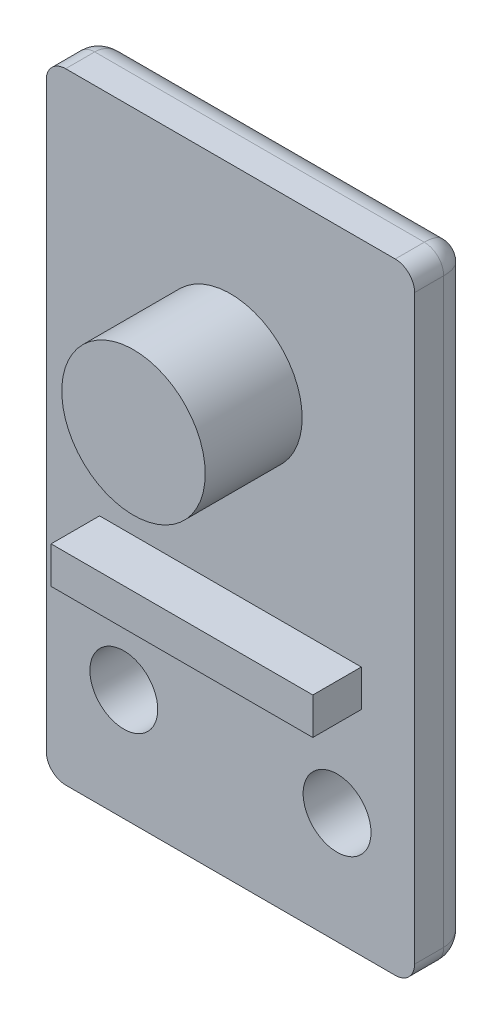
ISO-10303-21;
HEADER;
FILE_DESCRIPTION(('STEP AP214'),'2;1');
FILE_NAME('part.step','',(''),(''),'','','');
FILE_SCHEMA(('AUTOMOTIVE_DESIGN { 1 0 10303 214 1 1 1 1 }'));
ENDSEC;
DATA;
#1=APPLICATION_CONTEXT('core data for automotive mechanical design processes');
#2=APPLICATION_PROTOCOL_DEFINITION('international standard','automotive_design',2000,#1);
#3=PRODUCT_CONTEXT('',#1,'mechanical');
#4=PRODUCT('Part','Part','',(#3));
#5=PRODUCT_RELATED_PRODUCT_CATEGORY('part','',(#4));
#6=PRODUCT_DEFINITION_FORMATION('','',#4);
#7=PRODUCT_DEFINITION_CONTEXT('part definition',#1,'design');
#8=PRODUCT_DEFINITION('design','',#6,#7);
#9=PRODUCT_DEFINITION_SHAPE('','',#8);
#10=(LENGTH_UNIT() NAMED_UNIT(*) SI_UNIT(.MILLI.,.METRE.));
#11=(NAMED_UNIT(*) PLANE_ANGLE_UNIT() SI_UNIT($,.RADIAN.));
#12=(NAMED_UNIT(*) SI_UNIT($,.STERADIAN.) SOLID_ANGLE_UNIT());
#13=UNCERTAINTY_MEASURE_WITH_UNIT(LENGTH_MEASURE(1.E-05),#10,'distance_accuracy_value','');
#14=(GEOMETRIC_REPRESENTATION_CONTEXT(3) GLOBAL_UNCERTAINTY_ASSIGNED_CONTEXT((#13)) GLOBAL_UNIT_ASSIGNED_CONTEXT((#10,
#11,#12)) REPRESENTATION_CONTEXT('',''));
#15=CARTESIAN_POINT('',(0.,0.,0.));
#16=DIRECTION('',(0.,0.,1.));
#17=DIRECTION('',(1.,0.,0.));
#18=AXIS2_PLACEMENT_3D('',#15,#16,#17);
#19=CARTESIAN_POINT('',(8.5,-9.5,1.5));
#20=CARTESIAN_POINT('',(8.64959965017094,-9.5,1.5));
#21=CARTESIAN_POINT('',(8.87382526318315,-9.44864904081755,1.5));
#22=CARTESIAN_POINT('',(9.12869530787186,-9.28832458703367,1.5));
#23=CARTESIAN_POINT('',(9.31506766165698,-9.10215615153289,1.5));
#24=CARTESIAN_POINT('',(9.46187561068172,-8.83656565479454,1.5));
#25=CARTESIAN_POINT('',(9.50000000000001,-8.6121997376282,1.5));
#26=CARTESIAN_POINT('',(9.50000000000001,-8.5,1.5));
#27=CARTESIAN_POINT('',(8.5,-9.5,1.38780026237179));
#28=CARTESIAN_POINT('',(8.64959965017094,-9.5,1.37658483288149));
#29=CARTESIAN_POINT('',(8.87382526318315,-9.44864904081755,1.36367698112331));
#30=CARTESIAN_POINT('',(9.12869530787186,-9.28832458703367,1.3565996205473));
#31=CARTESIAN_POINT('',(9.31506766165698,-9.10215615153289,1.35658888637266));
#32=CARTESIAN_POINT('',(9.46187561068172,-8.83656565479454,1.36547403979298));
#33=CARTESIAN_POINT('',(9.50000000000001,-8.6121997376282,1.37940636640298));
#34=CARTESIAN_POINT('',(9.50000000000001,-8.5,1.38780026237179));
#35=CARTESIAN_POINT('',(8.49366801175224,-9.48100403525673,1.219516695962));
#36=CARTESIAN_POINT('',(8.6388147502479,-9.47700964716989,1.19182516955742));
#37=CARTESIAN_POINT('',(8.85636499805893,-9.42202768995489,1.15995669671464));
#38=CARTESIAN_POINT('',(9.10512795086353,-9.26212177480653,1.14250401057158));
#39=CARTESIAN_POINT('',(9.2884055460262,-9.07902138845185,1.14247480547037));
#40=CARTESIAN_POINT('',(9.43561422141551,-8.82020764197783,1.16438848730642));
#41=CARTESIAN_POINT('',(9.47798355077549,-8.60252182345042,1.1987785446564));
#42=CARTESIAN_POINT('',(9.48100403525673,-8.49366801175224,1.219516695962));
#43=CARTESIAN_POINT('',(8.46256992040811,-9.38770976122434,0.89558329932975));
#44=CARTESIAN_POINT('',(8.5887497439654,-9.36823355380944,0.846192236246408));
#45=CARTESIAN_POINT('',(8.77794669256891,-9.30051728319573,0.789943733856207));
#46=CARTESIAN_POINT('',(8.99993684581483,-9.14456836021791,0.759252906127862));
#47=CARTESIAN_POINT('',(9.16876183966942,-8.97586837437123,0.759209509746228));
#48=CARTESIAN_POINT('',(9.31525418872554,-8.74647253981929,0.797720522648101));
#49=CARTESIAN_POINT('',(9.37313353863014,-8.55721461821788,0.858591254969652));
#50=CARTESIAN_POINT('',(9.38770976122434,-8.46256992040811,0.895583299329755));
#51=CARTESIAN_POINT('',(8.3892696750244,-9.1678090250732,0.496973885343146));
#52=CARTESIAN_POINT('',(8.47893183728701,-9.12355973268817,0.445961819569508));
#53=CARTESIAN_POINT('',(8.61344962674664,-9.03896445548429,0.389505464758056));
#54=CARTESIAN_POINT('',(8.78106304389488,-8.89807581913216,0.359042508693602));
#55=CARTESIAN_POINT('',(8.91760958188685,-8.76156685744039,0.359017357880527));
#56=CARTESIAN_POINT('',(9.05465555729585,-8.59103537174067,0.397178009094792));
#57=CARTESIAN_POINT('',(9.13468435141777,-8.45653365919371,0.458736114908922));
#58=CARTESIAN_POINT('',(9.16780902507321,-8.3892696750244,0.49697388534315));
#59=CARTESIAN_POINT('',(8.22436773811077,-8.67310321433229,0.102430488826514));
#60=CARTESIAN_POINT('',(8.26697111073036,-8.63020086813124,0.088458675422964));
#61=CARTESIAN_POINT('',(8.33090170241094,-8.56596506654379,0.073741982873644));
#62=CARTESIAN_POINT('',(8.41626243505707,-8.48035757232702,0.065959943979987));
#63=CARTESIAN_POINT('',(8.49105269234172,-8.4055797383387,0.065961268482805));
#64=CARTESIAN_POINT('',(8.57668270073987,-8.3202442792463,0.075679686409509));
#65=CARTESIAN_POINT('',(8.64097371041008,-8.25633195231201,0.091937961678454));
#66=CARTESIAN_POINT('',(8.67310321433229,-8.22436773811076,0.102430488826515));
#67=CARTESIAN_POINT('',(8.07479982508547,-8.2243994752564,0.));
#68=CARTESIAN_POINT('',(8.08904741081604,-8.21015188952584,0.));
#69=CARTESIAN_POINT('',(8.11041878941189,-8.18878051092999,0.));
#70=CARTESIAN_POINT('',(8.13891396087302,-8.16028533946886,0.));
#71=CARTESIAN_POINT('',(8.16384723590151,-8.13535206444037,0.));
#72=CARTESIAN_POINT('',(8.19234240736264,-8.10685689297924,0.));
#73=CARTESIAN_POINT('',(8.21371378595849,-8.08548551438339,0.));
#74=CARTESIAN_POINT('',(8.22439947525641,-8.07479982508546,0.));
#75=CARTESIAN_POINT('',(8.,-7.99999999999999,0.));
#76=CARTESIAN_POINT('',(8.,-7.99999999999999,0.));
#77=CARTESIAN_POINT('',(8.,-7.99999999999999,0.));
#78=CARTESIAN_POINT('',(8.,-7.99999999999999,0.));
#79=CARTESIAN_POINT('',(8.,-7.99999999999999,0.));
#80=CARTESIAN_POINT('',(8.,-7.99999999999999,0.));
#81=CARTESIAN_POINT('',(8.,-7.99999999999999,0.));
#82=CARTESIAN_POINT('',(8.,-7.99999999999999,0.));
#83=B_SPLINE_SURFACE_WITH_KNOTS('',3,3,((#19,#20,#21,#22,#23,#24,#25,#26),(#27,#28,#29,#30,#31,
#32,#33,#34),(#35,#36,#37,#38,#39,#40,#41,#42),(#43,#44,#45,#46,#47,#48,#49,#50),(#51,#52,#53,
#54,#55,#56,#57,#58),(#59,#60,#61,#62,#63,#64,#65,#66),(#67,#68,#69,#70,#71,#72,#73,#74),(#75,
#76,#77,#78,#79,#80,#81,#82)),.UNSPECIFIED.,.F.,.F.,.F.,(4,1,1,1,1,4),(4,1,1,1,1,4),(0.,
0.224399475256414,0.336599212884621,0.673198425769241,1.12199737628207,1.5707963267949),(0.,
0.285714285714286,0.428571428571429,0.571428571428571,0.785714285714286,1.),.UNSPECIFIED.);
#84=CARTESIAN_POINT('',(8.,-7.99999999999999,0.));
#85=CARTESIAN_POINT('',(8.22439947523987,-8.07479982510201,0.));
#86=CARTESIAN_POINT('',(8.67310321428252,-8.22436773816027,0.102430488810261));
#87=CARTESIAN_POINT('',(9.1678090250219,-8.38926967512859,0.496973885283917));
#88=CARTESIAN_POINT('',(9.38770976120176,-8.46256992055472,0.895583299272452));
#89=CARTESIAN_POINT('',(9.48100403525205,-8.49366801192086,1.21951669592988));
#90=CARTESIAN_POINT('',(9.50000000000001,-8.5000000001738,1.38780026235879));
#91=CARTESIAN_POINT('',(9.50000000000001,-8.5000000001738,1.5));
#92=B_SPLINE_CURVE_WITH_KNOTS('',3,(#84,#85,#86,#87,#88,#89,#90,#91),.UNSPECIFIED.,.F.,.F.,(4,1,
1,1,1,4),(0.,0.448798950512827,0.897597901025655,1.23419711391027,1.34639685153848,
1.5707963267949),.UNSPECIFIED.);
#93=CARTESIAN_POINT('',(9.50000000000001,-8.50000000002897,1.5));
#94=VERTEX_POINT('',#93);
#95=CARTESIAN_POINT('',(8.,-8.,0.));
#96=VERTEX_POINT('',#95);
#97=EDGE_CURVE('E411',#94,#96,#92,.F.);
#98=CARTESIAN_POINT('',(9.50000000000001,-8.5,1.5));
#99=CARTESIAN_POINT('',(9.50000000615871,-8.5130898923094,1.5));
#100=CARTESIAN_POINT('',(9.49974054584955,-8.52617966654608,1.5));
#101=CARTESIAN_POINT('',(9.4987060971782,-8.55233882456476,1.5));
#102=CARTESIAN_POINT('',(9.49793110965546,-8.56540820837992,1.5));
#103=CARTESIAN_POINT('',(9.49586900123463,-8.59150660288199,1.5));
#104=CARTESIAN_POINT('',(9.49458187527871,-8.60453561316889,1.5));
#105=CARTESIAN_POINT('',(9.4914988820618,-8.63053336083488,1.5));
#106=CARTESIAN_POINT('',(9.48970301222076,-8.64350209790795,1.5));
#107=CARTESIAN_POINT('',(9.48560590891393,-8.66935937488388,1.5));
#108=CARTESIAN_POINT('',(9.48330467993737,-8.68224791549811,1.5));
#109=CARTESIAN_POINT('',(9.47820024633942,-8.70792488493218,1.5));
#110=CARTESIAN_POINT('',(9.47539705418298,-8.72071331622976,1.5));
#111=CARTESIAN_POINT('',(9.4692920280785,-8.74617013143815,1.5));
#112=CARTESIAN_POINT('',(9.46599021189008,-8.75883851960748,1.5));
#113=CARTESIAN_POINT('',(9.45889147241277,-8.7840353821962,1.5));
#114=CARTESIAN_POINT('',(9.45509456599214,-8.79656386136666,1.5));
#115=CARTESIAN_POINT('',(9.4470084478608,-8.82146078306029,1.5));
#116=CARTESIAN_POINT('',(9.44271924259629,-8.83382922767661,1.5));
#117=CARTESIAN_POINT('',(9.43365465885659,-8.85838694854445,1.5));
#118=CARTESIAN_POINT('',(9.42887926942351,-8.87057622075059,1.5));
#119=CARTESIAN_POINT('',(9.41885287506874,-8.89475808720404,1.5));
#120=CARTESIAN_POINT('',(9.41360185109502,-8.90675067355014,1.5));
#121=CARTESIAN_POINT('',(9.40263385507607,-8.93052136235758,1.5));
#122=CARTESIAN_POINT('',(9.39691686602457,-8.94229945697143,1.5));
#123=CARTESIAN_POINT('',(9.38502683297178,-8.9656234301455,1.5));
#124=CARTESIAN_POINT('',(9.37885378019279,-8.9771693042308,1.5));
#125=CARTESIAN_POINT('',(9.36606144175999,-9.0000110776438,1.5));
#126=CARTESIAN_POINT('',(9.3594421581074,-9.01130697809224,1.5));
#127=CARTESIAN_POINT('',(9.34576720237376,-9.03363105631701,1.5));
#128=CARTESIAN_POINT('',(9.33871154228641,-9.04465924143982,1.5));
#129=CARTESIAN_POINT('',(9.32417364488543,-9.06643011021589,1.5));
#130=CARTESIAN_POINT('',(9.3166914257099,-9.07717280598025,1.5));
#131=CARTESIAN_POINT('',(9.3013103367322,-9.09835502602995,1.5));
#132=CARTESIAN_POINT('',(9.29341148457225,-9.10879456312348,1.5));
#133=CARTESIAN_POINT('',(9.27720664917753,-9.12935240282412,1.5));
#134=CARTESIAN_POINT('',(9.2689006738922,-9.13947071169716,1.5));
#135=CARTESIAN_POINT('',(9.25189595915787,-9.15937193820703,1.5));
#136=CARTESIAN_POINT('',(9.24319721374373,-9.16915485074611,1.5));
#137=CARTESIAN_POINT('',(9.22542194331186,-9.18837180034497,1.5));
#138=CARTESIAN_POINT('',(9.21634540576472,-9.19780582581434,1.5));
#139=CARTESIAN_POINT('',(9.19782934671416,-9.21631134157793,1.5));
#140=CARTESIAN_POINT('',(9.18838981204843,-9.22538281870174,1.5));
#141=CARTESIAN_POINT('',(9.16916261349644,-9.24314963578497,1.5));
#142=CARTESIAN_POINT('',(9.15937493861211,-9.25184496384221,1.5));
#143=CARTESIAN_POINT('',(9.13946623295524,-9.26884579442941,1.5));
#144=CARTESIAN_POINT('',(9.12934519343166,-9.27715128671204,1.5));
#145=CARTESIAN_POINT('',(9.10878486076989,-9.29335897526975,1.5));
#146=CARTESIAN_POINT('',(9.09834556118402,-9.30126116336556,1.5));
#147=CARTESIAN_POINT('',(9.07716550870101,-9.31665060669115,1.5));
#148=CARTESIAN_POINT('',(9.0664247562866,-9.32413786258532,1.5));
#149=CARTESIAN_POINT('',(9.04465846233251,-9.33868562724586,1.5));
#150=CARTESIAN_POINT('',(9.03363292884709,-9.34574614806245,1.5));
#151=CARTESIAN_POINT('',(9.01131375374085,-9.35942861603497,1.5));
#152=CARTESIAN_POINT('',(9.00002012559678,-9.36605058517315,1.5));
#153=CARTESIAN_POINT('',(8.97718153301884,-9.37884431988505,1.5));
#154=CARTESIAN_POINT('',(8.96563658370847,-9.38501611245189,1.5));
#155=CARTESIAN_POINT('',(8.942311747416,-9.39689710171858,1.5));
#156=CARTESIAN_POINT('',(8.930531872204,-9.40260632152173,1.5));
#157=CARTESIAN_POINT('',(8.90675517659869,-9.41355322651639,1.5));
#158=CARTESIAN_POINT('',(8.89475835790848,-9.41879091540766,1.5));
#159=CARTESIAN_POINT('',(8.87056768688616,-9.42879065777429,1.5));
#160=CARTESIAN_POINT('',(8.8583738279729,-9.43355269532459,1.5));
#161=CARTESIAN_POINT('',(8.83380851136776,-9.44259612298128,1.5));
#162=CARTESIAN_POINT('',(8.82143704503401,-9.44687748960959,1.5));
#163=CARTESIAN_POINT('',(8.79653606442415,-9.45495479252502,1.5));
#164=CARTESIAN_POINT('',(8.78400654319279,-9.45875070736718,1.5));
#165=CARTESIAN_POINT('',(8.75880896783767,-9.4658522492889,1.5));
#166=CARTESIAN_POINT('',(8.74614091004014,-9.46915786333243,1.5));
#167=CARTESIAN_POINT('',(8.72068578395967,-9.47527395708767,1.5));
#168=CARTESIAN_POINT('',(8.70789871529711,-9.47808443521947,1.5));
#169=CARTESIAN_POINT('',(8.68222508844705,-9.48320540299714,1.5));
#170=CARTESIAN_POINT('',(8.66933853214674,-9.48551590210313,1.5));
#171=CARTESIAN_POINT('',(8.64348545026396,-9.48963205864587,1.5));
#172=CARTESIAN_POINT('',(8.63051892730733,-9.49143773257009,1.5));
#173=CARTESIAN_POINT('',(8.60452544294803,-9.49453939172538,1.5));
#174=CARTESIAN_POINT('',(8.59149848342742,-9.49583539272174,1.5));
#175=CARTESIAN_POINT('',(8.56540362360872,-9.49791285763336,1.5));
#176=CARTESIAN_POINT('',(8.55233572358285,-9.49869432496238,1.5));
#177=CARTESIAN_POINT('',(8.52617860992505,-9.49973792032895,1.5));
#178=CARTESIAN_POINT('',(8.51308939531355,-9.50000002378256,1.5));
#179=CARTESIAN_POINT('',(8.5,-9.5,1.5));
#180=B_SPLINE_CURVE_WITH_KNOTS('',3,(#98,#99,#100,#101,#102,#103,#104,#105,#106,#107,#108,#109,
#110,#111,#112,#113,#114,#115,#116,#117,#118,#119,#120,#121,#122,#123,#124,#125,#126,#127,#128,
#129,#130,#131,#132,#133,#134,#135,#136,#137,#138,#139,#140,#141,#142,#143,#144,#145,#146,#147,
#148,#149,#150,#151,#152,#153,#154,#155,#156,#157,#158,#159,#160,#161,#162,#163,#164,#165,#166,
#167,#168,#169,#170,#171,#172,#173,#174,#175,#176,#177,#178,#179),.UNSPECIFIED.,.F.,.F.,(4,2,2,
2,2,2,2,2,2,2,2,2,2,2,2,2,2,2,2,2,2,2,2,2,2,2,2,2,2,2,2,2,2,2,2,2,2,2,2,2,4),(0.,
0.0392669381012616,0.0785338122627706,0.117801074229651,0.157068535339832,0.196335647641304,
0.235601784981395,0.274866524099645,0.314129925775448,0.353392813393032,0.392656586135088,
0.431921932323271,0.471188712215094,0.510456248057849,0.549723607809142,0.58898988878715,
0.628254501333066,0.66751745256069,0.706779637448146,0.746042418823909,0.78530650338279,
0.824572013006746,0.863838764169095,0.903106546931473,0.942375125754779,0.981643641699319,
1.02091104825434,1.06017648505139,1.09943956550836,1.13870068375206,1.17796149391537,
1.217223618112,1.25648765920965,1.29575343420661,1.33502025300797,1.37428719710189,
1.41355339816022,1.45281831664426,1.49208202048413,1.5313454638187,1.57061076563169),.UNSPECIFIED.);
#181=CARTESIAN_POINT('',(8.5,-9.5,1.5));
#182=VERTEX_POINT('',#181);
#183=EDGE_CURVE('E634',#94,#182,#180,.T.);
#184=CARTESIAN_POINT('',(8.5,-9.5,1.5));
#185=CARTESIAN_POINT('',(8.50000003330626,-9.50000009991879,1.48036462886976));
#186=CARTESIAN_POINT('',(8.49987071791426,-9.4996121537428,1.46072942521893));
#187=CARTESIAN_POINT('',(8.49935491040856,-9.49806473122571,1.42148964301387));
#188=CARTESIAN_POINT('',(8.49896837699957,-9.49690513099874,1.40188506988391));
#189=CARTESIAN_POINT('',(8.49793948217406,-9.49381844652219,1.36273658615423));
#190=CARTESIAN_POINT('',(8.49729703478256,-9.4918911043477,1.34319269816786));
#191=CARTESIAN_POINT('',(8.49575769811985,-9.48727309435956,1.3041954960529));
#192=CARTESIAN_POINT('',(8.49486068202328,-9.48458204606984,1.28474223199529));
#193=CARTESIAN_POINT('',(8.49281360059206,-9.47844080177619,1.24595619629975));
#194=CARTESIAN_POINT('',(8.49166336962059,-9.47499010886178,1.22662351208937));
#195=CARTESIAN_POINT('',(8.48911116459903,-9.4673334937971,1.1881085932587));
#196=CARTESIAN_POINT('',(8.48770898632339,-9.46312695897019,1.16892649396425));
#197=CARTESIAN_POINT('',(8.48465455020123,-9.45396365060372,1.13074249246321));
#198=CARTESIAN_POINT('',(8.48300204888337,-9.44900614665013,1.11174078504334));
#199=CARTESIAN_POINT('',(8.47944968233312,-9.43834904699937,1.07394640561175));
#200=CARTESIAN_POINT('',(8.47754953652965,-9.43264860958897,1.05515399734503));
#201=CARTESIAN_POINT('',(8.47350420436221,-9.42051261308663,1.01780741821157));
#202=CARTESIAN_POINT('',(8.47135870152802,-9.41407610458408,0.999253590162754));
#203=CARTESIAN_POINT('',(8.4668261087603,-9.40047832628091,0.962412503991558));
#204=CARTESIAN_POINT('',(8.46443867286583,-9.3933160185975,0.944125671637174));
#205=CARTESIAN_POINT('',(8.45942708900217,-9.37828126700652,0.907845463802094));
#206=CARTESIAN_POINT('',(8.45680257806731,-9.37040773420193,0.889852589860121));
#207=CARTESIAN_POINT('',(8.45132143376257,-9.3539643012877,0.854187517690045));
#208=CARTESIAN_POINT('',(8.44846442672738,-9.34539328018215,0.836515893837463));
#209=CARTESIAN_POINT('',(8.4425229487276,-9.32756884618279,0.801520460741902));
#210=CARTESIAN_POINT('',(8.43943809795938,-9.31831429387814,0.784197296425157));
#211=CARTESIAN_POINT('',(8.43304556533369,-9.29913669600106,0.749925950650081));
#212=CARTESIAN_POINT('',(8.42973750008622,-9.28921250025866,0.732978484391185));
#213=CARTESIAN_POINT('',(8.42290317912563,-9.26870953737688,0.699485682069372));
#214=CARTESIAN_POINT('',(8.41937653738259,-9.25812961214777,0.682941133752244));
#215=CARTESIAN_POINT('',(8.41210968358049,-9.23632905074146,0.65028137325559));
#216=CARTESIAN_POINT('',(8.4083690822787,-9.22510724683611,0.634167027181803));
#217=CARTESIAN_POINT('',(8.40067899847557,-9.20203699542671,0.602394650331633));
#218=CARTESIAN_POINT('',(8.39672912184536,-9.19018736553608,0.586737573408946));
#219=CARTESIAN_POINT('',(8.38862493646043,-9.16587480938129,0.555907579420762));
#220=CARTESIAN_POINT('',(8.38447022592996,-9.15341067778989,0.540735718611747));
#221=CARTESIAN_POINT('',(8.3759639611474,-9.12789188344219,0.510896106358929));
#222=CARTESIAN_POINT('',(8.37161200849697,-9.1148360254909,0.496229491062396));
#223=CARTESIAN_POINT('',(8.36271925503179,-9.08815776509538,0.467419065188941));
#224=CARTESIAN_POINT('',(8.35817806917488,-9.07453420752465,0.453276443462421));
#225=CARTESIAN_POINT('',(8.34891472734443,-9.0467441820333,0.425533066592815));
#226=CARTESIAN_POINT('',(8.34419220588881,-9.03257661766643,0.411933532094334));
#227=CARTESIAN_POINT('',(8.33457409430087,-9.00372228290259,0.385295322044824));
#228=CARTESIAN_POINT('',(8.32967816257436,-8.98903448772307,0.372257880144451));
#229=CARTESIAN_POINT('',(8.319721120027,-8.95916336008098,0.346762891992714));
#230=CARTESIAN_POINT('',(8.31465969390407,-8.94397908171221,0.334306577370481));
#231=CARTESIAN_POINT('',(8.30437955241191,-8.91313865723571,0.309992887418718));
#232=CARTESIAN_POINT('',(8.29916054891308,-8.89748164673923,0.298136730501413));
#233=CARTESIAN_POINT('',(8.28857314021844,-8.86571942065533,0.275042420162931));
#234=CARTESIAN_POINT('',(8.28320447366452,-8.84961342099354,0.263805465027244));
#235=CARTESIAN_POINT('',(8.27232563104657,-8.81697689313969,0.241968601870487));
#236=CARTESIAN_POINT('',(8.26681521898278,-8.80044565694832,0.23136986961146));
#237=CARTESIAN_POINT('',(8.25566076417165,-8.76698229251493,0.210828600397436));
#238=CARTESIAN_POINT('',(8.25001650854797,-8.7500495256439,0.200887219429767));
#239=CARTESIAN_POINT('',(8.23860230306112,-8.71580690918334,0.181679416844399));
#240=CARTESIAN_POINT('',(8.23283216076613,-8.69849648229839,0.172414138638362));
#241=CARTESIAN_POINT('',(8.22117391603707,-8.66352174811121,0.154578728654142));
#242=CARTESIAN_POINT('',(8.21528563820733,-8.64585691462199,0.146009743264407));
#243=CARTESIAN_POINT('',(8.20339992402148,-8.61019977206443,0.129580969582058));
#244=CARTESIAN_POINT('',(8.19740233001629,-8.59220699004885,0.121722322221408));
#245=CARTESIAN_POINT('',(8.18530805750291,-8.55592417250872,0.106719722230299));
#246=CARTESIAN_POINT('',(8.17921124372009,-8.53763373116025,0.0995768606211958));
#247=CARTESIAN_POINT('',(8.16692835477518,-8.50078506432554,0.0860130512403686));
#248=CARTESIAN_POINT('',(8.16074216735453,-8.4822265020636,0.0795931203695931));
#249=CARTESIAN_POINT('',(8.14829042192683,-8.44487126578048,0.0674819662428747));
#250=CARTESIAN_POINT('',(8.14202477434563,-8.42607432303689,0.061791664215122));
#251=CARTESIAN_POINT('',(8.12942398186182,-8.38827194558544,0.0511467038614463));
#252=CARTESIAN_POINT('',(8.12308876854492,-8.36926630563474,0.0461928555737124));
#253=CARTESIAN_POINT('',(8.110358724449,-8.33107617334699,0.0370277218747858));
#254=CARTESIAN_POINT('',(8.1039638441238,-8.31189153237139,0.0328171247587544));
#255=CARTESIAN_POINT('',(8.09112434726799,-8.27337304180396,0.0251454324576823));
#256=CARTESIAN_POINT('',(8.08467969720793,-8.25403909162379,0.0216848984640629));
#257=CARTESIAN_POINT('',(8.07175054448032,-8.21525163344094,0.0155202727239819));
#258=CARTESIAN_POINT('',(8.06526602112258,-8.19579806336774,0.0128166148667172));
#259=CARTESIAN_POINT('',(8.05226701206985,-8.15680103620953,0.00817268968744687));
#260=CARTESIAN_POINT('',(8.04575251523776,-8.13725754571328,0.00623273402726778));
#261=CARTESIAN_POINT('',(8.03270343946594,-8.09811031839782,0.0031231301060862));
#262=CARTESIAN_POINT('',(8.02616885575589,-8.07850656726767,0.00195368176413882));
#263=CARTESIAN_POINT('',(8.01308953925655,-8.03926861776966,0.000392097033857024));
#264=CARTESIAN_POINT('',(8.00654480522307,-8.01963441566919,6.49709311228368E-08));
#265=CARTESIAN_POINT('',(8.,-7.99999999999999,0.));
#266=B_SPLINE_CURVE_WITH_KNOTS('',3,(#184,#185,#186,#187,#188,#189,#190,#191,#192,#193,#194,
#195,#196,#197,#198,#199,#200,#201,#202,#203,#204,#205,#206,#207,#208,#209,#210,#211,#212,#213,
#214,#215,#216,#217,#218,#219,#220,#221,#222,#223,#224,#225,#226,#227,#228,#229,#230,#231,#232,
#233,#234,#235,#236,#237,#238,#239,#240,#241,#242,#243,#244,#245,#246,#247,#248,#249,#250,#251,
#252,#253,#254,#255,#256,#257,#258,#259,#260,#261,#262,#263,#264,#265),.UNSPECIFIED.,.F.,.F.,(4,
2,2,2,2,2,2,2,2,2,2,2,2,2,2,2,2,2,2,2,2,2,2,2,2,2,2,2,2,2,2,2,2,2,2,2,2,2,2,2,4),(0.,
0.0589016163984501,0.11781269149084,0.176743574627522,0.235703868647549,0.294702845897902,
0.353749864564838,0.41285468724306,0.472027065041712,0.531276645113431,0.590612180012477,
0.650040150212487,0.709565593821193,0.769192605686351,0.828924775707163,0.888765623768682,
0.948719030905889,1.0087896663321,1.06898321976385,1.12930430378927,1.18975477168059,
1.25033423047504,1.31104050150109,1.37187007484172,1.43281855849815,1.49388112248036,
1.55505293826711,1.61632961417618,1.67770762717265,1.73918472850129,1.80075888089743,
1.86242550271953,1.92417781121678,1.98600733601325,2.0479043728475,2.10985843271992,
2.17185868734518,2.23389441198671,2.29595542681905,2.35803253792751,2.42011797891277),.UNSPECIFIED.);
#267=EDGE_CURVE('E334',#96,#182,#266,.F.);
#268=ORIENTED_EDGE('',*,*,#97,.F.);
#269=ORIENTED_EDGE('',*,*,#183,.T.);
#270=ORIENTED_EDGE('',*,*,#267,.F.);
#271=EDGE_LOOP('',(#268,#269,#270));
#272=FACE_BOUND('',#271,.T.);
#273=ADVANCED_FACE('F16',(#272),#83,.T.);
#274=CARTESIAN_POINT('',(9.5,21.5,1.5));
#275=CARTESIAN_POINT('',(9.5,21.6495996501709,1.5));
#276=CARTESIAN_POINT('',(9.4486455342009,21.8738214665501,1.5));
#277=CARTESIAN_POINT('',(9.28832748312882,22.1287026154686,1.5));
#278=CARTESIAN_POINT('',(9.10215322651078,22.3150646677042,1.5));
#279=CARTESIAN_POINT('',(8.83656581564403,22.4618772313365,1.5));
#280=CARTESIAN_POINT('',(8.61219973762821,22.5,1.5));
#281=CARTESIAN_POINT('',(8.5,22.5,1.5));
#282=CARTESIAN_POINT('',(9.5,21.5,1.38780026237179));
#283=CARTESIAN_POINT('',(9.5,21.6495996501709,1.3765841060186));
#284=CARTESIAN_POINT('',(9.4486455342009,21.8738214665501,1.36367785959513));
#285=CARTESIAN_POINT('',(9.28832748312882,22.1287026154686,1.35659921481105));
#286=CARTESIAN_POINT('',(9.10215322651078,22.3150646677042,1.3565890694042));
#287=CARTESIAN_POINT('',(8.83656581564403,22.4618772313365,1.36547389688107));
#288=CARTESIAN_POINT('',(8.61219973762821,22.5,1.37940644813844));
#289=CARTESIAN_POINT('',(8.5,22.5,1.38780026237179));
#290=CARTESIAN_POINT('',(9.47476072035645,21.4915869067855,1.163380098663));
#291=CARTESIAN_POINT('',(9.46929669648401,21.6351581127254,1.12990891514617));
#292=CARTESIAN_POINT('',(9.41296528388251,21.8503523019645,1.09140918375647));
#293=CARTESIAN_POINT('',(9.25311469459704,22.0970070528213,1.07031256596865));
#294=CARTESIAN_POINT('',(9.07103700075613,22.2792434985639,1.07028071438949));
#295=CARTESIAN_POINT('',(8.8145859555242,22.4266996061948,1.09676198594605));
#296=CARTESIAN_POINT('',(8.59926085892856,22.4706437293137,1.13832083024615));
#297=CARTESIAN_POINT('',(8.49158690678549,22.4747607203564,1.163380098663));
#298=CARTESIAN_POINT('',(9.36281472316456,21.4542715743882,0.843748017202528));
#299=CARTESIAN_POINT('',(9.33967416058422,21.5757474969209,0.793183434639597));
#300=CARTESIAN_POINT('',(9.2691248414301,21.7579074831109,0.735831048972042));
#301=CARTESIAN_POINT('',(9.1145041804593,21.9731253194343,0.704568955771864));
#302=CARTESIAN_POINT('',(8.94958719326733,22.1381455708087,0.704530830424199));
#303=CARTESIAN_POINT('',(8.72759901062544,22.28409095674,0.743741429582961));
#304=CARTESIAN_POINT('',(8.54539176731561,22.3455013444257,0.805880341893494));
#305=CARTESIAN_POINT('',(8.45427157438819,22.3628147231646,0.843748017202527));
#306=CARTESIAN_POINT('',(9.12276814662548,21.3742560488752,0.46113215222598));
#307=CARTESIAN_POINT('',(9.07868564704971,21.4596938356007,0.413727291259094));
#308=CARTESIAN_POINT('',(8.996067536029,21.5878836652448,0.36136893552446));
#309=CARTESIAN_POINT('',(8.86026237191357,21.7480706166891,0.33312831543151));
#310=CARTESIAN_POINT('',(8.72937415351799,21.8789945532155,0.333108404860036));
#311=CARTESIAN_POINT('',(8.56652382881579,22.0112894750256,0.368476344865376));
#312=CARTESIAN_POINT('',(8.43835563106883,22.0897821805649,0.425600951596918));
#313=CARTESIAN_POINT('',(8.37425604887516,22.1227681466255,0.46113215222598));
#314=CARTESIAN_POINT('',(8.67314741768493,21.2243824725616,0.102440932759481));
#315=CARTESIAN_POINT('',(8.63018395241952,21.2669351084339,0.088227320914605));
#316=CARTESIAN_POINT('',(8.56588323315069,21.3307975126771,0.073227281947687));
#317=CARTESIAN_POINT('',(8.48021816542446,21.4161207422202,0.065286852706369));
#318=CARTESIAN_POINT('',(8.40543559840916,21.4909156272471,0.065288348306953));
#319=CARTESIAN_POINT('',(8.32015056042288,21.5766129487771,0.075205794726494));
#320=CARTESIAN_POINT('',(8.25631179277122,21.6409824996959,0.09176926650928));
#321=CARTESIAN_POINT('',(8.22438247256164,21.6731474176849,0.102440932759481));
#322=CARTESIAN_POINT('',(8.22439947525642,21.0747998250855,0.));
#323=CARTESIAN_POINT('',(8.21015188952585,21.089047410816,0.));
#324=CARTESIAN_POINT('',(8.18878051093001,21.1104187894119,0.));
#325=CARTESIAN_POINT('',(8.16028533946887,21.138913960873,0.));
#326=CARTESIAN_POINT('',(8.13535206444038,21.1638472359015,0.));
#327=CARTESIAN_POINT('',(8.10685689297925,21.1923424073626,0.));
#328=CARTESIAN_POINT('',(8.0854855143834,21.2137137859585,0.));
#329=CARTESIAN_POINT('',(8.07479982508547,21.2243994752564,0.));
#330=CARTESIAN_POINT('',(8.,21.,0.));
#331=CARTESIAN_POINT('',(8.,21.,0.));
#332=CARTESIAN_POINT('',(8.,21.,0.));
#333=CARTESIAN_POINT('',(8.,21.,0.));
#334=CARTESIAN_POINT('',(8.,21.,0.));
#335=CARTESIAN_POINT('',(8.,21.,0.));
#336=CARTESIAN_POINT('',(8.,21.,0.));
#337=CARTESIAN_POINT('',(8.,21.,0.));
#338=B_SPLINE_SURFACE_WITH_KNOTS('',3,3,((#274,#275,#276,#277,#278,#279,#280,#281),(#282,#283,
#284,#285,#286,#287,#288,#289),(#290,#291,#292,#293,#294,#295,#296,#297),(#298,#299,#300,#301,
#302,#303,#304,#305),(#306,#307,#308,#309,#310,#311,#312,#313),(#314,#315,#316,#317,#318,#319,
#320,#321),(#322,#323,#324,#325,#326,#327,#328,#329),(#330,#331,#332,#333,#334,#335,#336,#337)),
.UNSPECIFIED.,.F.,.F.,.F.,(4,1,1,1,1,4),(4,1,1,1,1,4),(0.,0.224399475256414,0.448798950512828,
0.673198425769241,1.12199737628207,1.5707963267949),(0.,0.285714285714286,0.428571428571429,
0.571428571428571,0.785714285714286,1.),.UNSPECIFIED.);
#339=CARTESIAN_POINT('',(8.,21.,0.));
#340=CARTESIAN_POINT('',(8.07479982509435,21.2243994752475,0.));
#341=CARTESIAN_POINT('',(8.22438247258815,21.6731474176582,0.102440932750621));
#342=CARTESIAN_POINT('',(8.37425604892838,22.1227681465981,0.46113215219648));
#343=CARTESIAN_POINT('',(8.45427157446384,22.3628147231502,0.843748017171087));
#344=CARTESIAN_POINT('',(8.49158690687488,22.474760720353,1.16338009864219));
#345=CARTESIAN_POINT('',(8.50000000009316,22.5,1.38780026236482));
#346=CARTESIAN_POINT('',(8.50000000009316,22.5,1.5));
#347=B_SPLINE_CURVE_WITH_KNOTS('',3,(#339,#340,#341,#342,#343,#344,#345,#346),.UNSPECIFIED.,.F.,
.F.,(4,1,1,1,1,4),(0.,0.448798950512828,0.897597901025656,1.12199737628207,1.34639685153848,
1.5707963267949),.UNSPECIFIED.);
#348=CARTESIAN_POINT('',(8.50000000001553,22.5,1.5));
#349=VERTEX_POINT('',#348);
#350=CARTESIAN_POINT('',(8.,21.,0.));
#351=VERTEX_POINT('',#350);
#352=EDGE_CURVE('E267',#349,#351,#347,.F.);
#353=CARTESIAN_POINT('',(8.5,22.5,1.5));
#354=CARTESIAN_POINT('',(8.61219973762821,22.5,1.5));
#355=CARTESIAN_POINT('',(8.83656581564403,22.4618772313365,1.5));
#356=CARTESIAN_POINT('',(9.10215322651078,22.3150646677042,1.5));
#357=CARTESIAN_POINT('',(9.28832748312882,22.1287026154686,1.5));
#358=CARTESIAN_POINT('',(9.4486455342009,21.8738214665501,1.5));
#359=CARTESIAN_POINT('',(9.5,21.6495996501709,1.5));
#360=CARTESIAN_POINT('',(9.5,21.5,1.5));
#361=B_SPLINE_CURVE_WITH_KNOTS('',3,(#353,#354,#355,#356,#357,#358,#359,#360),.UNSPECIFIED.,.F.,
.F.,(4,1,1,1,1,4),(0.,0.214285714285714,0.428571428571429,0.571428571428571,0.714285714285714,
1.),.UNSPECIFIED.);
#362=CARTESIAN_POINT('',(9.5,21.5,1.5));
#363=VERTEX_POINT('',#362);
#364=EDGE_CURVE('E541',#349,#363,#361,.T.);
#365=CARTESIAN_POINT('',(9.50000000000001,21.5,1.5));
#366=CARTESIAN_POINT('',(9.50000000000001,21.5,1.38780026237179));
#367=CARTESIAN_POINT('',(9.47476072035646,21.4915869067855,1.163380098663));
#368=CARTESIAN_POINT('',(9.36281472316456,21.4542715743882,0.843748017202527));
#369=CARTESIAN_POINT('',(9.12276814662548,21.3742560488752,0.461132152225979));
#370=CARTESIAN_POINT('',(8.67314741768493,21.2243824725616,0.102440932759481));
#371=CARTESIAN_POINT('',(8.22439947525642,21.0747998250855,0.));
#372=CARTESIAN_POINT('',(8.,21.,0.));
#373=B_SPLINE_CURVE_WITH_KNOTS('',3,(#365,#366,#367,#368,#369,#370,#371,#372),.UNSPECIFIED.,.F.,
.F.,(4,1,1,1,1,4),(0.,0.224399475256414,0.448798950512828,0.673198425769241,1.12199737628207,
1.5707963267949),.UNSPECIFIED.);
#374=EDGE_CURVE('E286',#351,#363,#373,.F.);
#375=ORIENTED_EDGE('',*,*,#352,.F.);
#376=ORIENTED_EDGE('',*,*,#364,.T.);
#377=ORIENTED_EDGE('',*,*,#374,.F.);
#378=EDGE_LOOP('',(#375,#376,#377));
#379=FACE_BOUND('',#378,.T.);
#380=ADVANCED_FACE('F386',(#379),#338,.T.);
#381=CARTESIAN_POINT('',(-8.5,22.5,1.5));
#382=CARTESIAN_POINT('',(-8.64959965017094,22.5,1.5));
#383=CARTESIAN_POINT('',(-8.87382146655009,22.4486455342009,1.5));
#384=CARTESIAN_POINT('',(-9.12870261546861,22.2883274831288,1.5));
#385=CARTESIAN_POINT('',(-9.31506466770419,22.1021532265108,1.5));
#386=CARTESIAN_POINT('',(-9.46187723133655,21.836565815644,1.5));
#387=CARTESIAN_POINT('',(-9.5,21.6121997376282,1.5));
#388=CARTESIAN_POINT('',(-9.5,21.5,1.5));
#389=CARTESIAN_POINT('',(-8.5,22.5,1.38780026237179));
#390=CARTESIAN_POINT('',(-8.64959965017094,22.5,1.3765841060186));
#391=CARTESIAN_POINT('',(-8.87382146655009,22.4486455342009,1.36367785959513));
#392=CARTESIAN_POINT('',(-9.12870261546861,22.2883274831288,1.35659921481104));
#393=CARTESIAN_POINT('',(-9.31506466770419,22.1021532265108,1.3565890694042));
#394=CARTESIAN_POINT('',(-9.46187723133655,21.836565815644,1.36547389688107));
#395=CARTESIAN_POINT('',(-9.5,21.6121997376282,1.37940644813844));
#396=CARTESIAN_POINT('',(-9.5,21.5,1.38780026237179));
#397=CARTESIAN_POINT('',(-8.49158690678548,22.4747607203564,1.16338009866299));
#398=CARTESIAN_POINT('',(-8.63515811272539,22.469296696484,1.12990891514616));
#399=CARTESIAN_POINT('',(-8.85035230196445,22.4129652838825,1.09140918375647));
#400=CARTESIAN_POINT('',(-9.09700705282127,22.253114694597,1.07031256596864));
#401=CARTESIAN_POINT('',(-9.27924349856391,22.0710370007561,1.07028071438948));
#402=CARTESIAN_POINT('',(-9.42669960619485,21.8145859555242,1.09676198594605));
#403=CARTESIAN_POINT('',(-9.47064372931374,21.5992608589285,1.13832083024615));
#404=CARTESIAN_POINT('',(-9.47476072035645,21.4915869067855,1.163380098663));
#405=CARTESIAN_POINT('',(-8.45427157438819,22.3628147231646,0.843748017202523));
#406=CARTESIAN_POINT('',(-8.5757474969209,22.3396741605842,0.793183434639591));
#407=CARTESIAN_POINT('',(-8.75790748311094,22.2691248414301,0.735831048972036));
#408=CARTESIAN_POINT('',(-8.97312531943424,22.1145041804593,0.704568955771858));
#409=CARTESIAN_POINT('',(-9.13814557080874,21.9495871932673,0.704530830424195));
#410=CARTESIAN_POINT('',(-9.28409095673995,21.7275990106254,0.743741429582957));
#411=CARTESIAN_POINT('',(-9.34550134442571,21.5453917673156,0.805880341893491));
#412=CARTESIAN_POINT('',(-9.36281472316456,21.4542715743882,0.843748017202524));
#413=CARTESIAN_POINT('',(-8.37425604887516,22.1227681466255,0.461132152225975));
#414=CARTESIAN_POINT('',(-8.45969383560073,22.0786856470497,0.413727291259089));
#415=CARTESIAN_POINT('',(-8.58788366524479,21.996067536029,0.361368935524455));
#416=CARTESIAN_POINT('',(-8.74807061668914,21.8602623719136,0.333128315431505));
#417=CARTESIAN_POINT('',(-8.87899455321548,21.729374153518,0.333108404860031));
#418=CARTESIAN_POINT('',(-9.01128947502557,21.5665238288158,0.368476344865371));
#419=CARTESIAN_POINT('',(-9.08978218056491,21.4383556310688,0.425600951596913));
#420=CARTESIAN_POINT('',(-9.12276814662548,21.3742560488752,0.461132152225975));
#421=CARTESIAN_POINT('',(-8.22438247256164,21.6731474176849,0.102440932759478));
#422=CARTESIAN_POINT('',(-8.26693510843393,21.6301839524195,0.088227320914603));
#423=CARTESIAN_POINT('',(-8.33079751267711,21.5658832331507,0.073227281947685));
#424=CARTESIAN_POINT('',(-8.41612074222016,21.4802181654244,0.065286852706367));
#425=CARTESIAN_POINT('',(-8.49091562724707,21.4054355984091,0.06528834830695));
#426=CARTESIAN_POINT('',(-8.57661294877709,21.3201505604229,0.075205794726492));
#427=CARTESIAN_POINT('',(-8.64098249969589,21.2563117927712,0.091769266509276));
#428=CARTESIAN_POINT('',(-8.67314741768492,21.2243824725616,0.102440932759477));
#429=CARTESIAN_POINT('',(-8.07479982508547,21.2243994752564,0.));
#430=CARTESIAN_POINT('',(-8.08904741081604,21.2101518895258,0.));
#431=CARTESIAN_POINT('',(-8.11041878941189,21.18878051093,0.));
#432=CARTESIAN_POINT('',(-8.13891396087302,21.1602853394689,0.));
#433=CARTESIAN_POINT('',(-8.16384723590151,21.1353520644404,0.));
#434=CARTESIAN_POINT('',(-8.19234240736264,21.1068568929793,0.));
#435=CARTESIAN_POINT('',(-8.21371378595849,21.0854855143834,0.));
#436=CARTESIAN_POINT('',(-8.22439947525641,21.0747998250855,0.));
#437=CARTESIAN_POINT('',(-8.,21.,0.));
#438=CARTESIAN_POINT('',(-8.,21.,0.));
#439=CARTESIAN_POINT('',(-8.,21.,0.));
#440=CARTESIAN_POINT('',(-8.,21.,0.));
#441=CARTESIAN_POINT('',(-8.,21.,0.));
#442=CARTESIAN_POINT('',(-8.,21.,0.));
#443=CARTESIAN_POINT('',(-8.,21.,0.));
#444=CARTESIAN_POINT('',(-8.,21.,0.));
#445=B_SPLINE_SURFACE_WITH_KNOTS('',3,3,((#381,#382,#383,#384,#385,#386,#387,#388),(#389,#390,
#391,#392,#393,#394,#395,#396),(#397,#398,#399,#400,#401,#402,#403,#404),(#405,#406,#407,#408,
#409,#410,#411,#412),(#413,#414,#415,#416,#417,#418,#419,#420),(#421,#422,#423,#424,#425,#426,
#427,#428),(#429,#430,#431,#432,#433,#434,#435,#436),(#437,#438,#439,#440,#441,#442,#443,#444)),
.UNSPECIFIED.,.F.,.F.,.F.,(4,1,1,1,1,4),(4,1,1,1,1,4),(0.,0.224399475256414,0.448798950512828,
0.673198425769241,1.12199737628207,1.5707963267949),(0.,0.285714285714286,0.428571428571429,
0.571428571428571,0.785714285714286,1.),.UNSPECIFIED.);
#446=CARTESIAN_POINT('',(-8.,21.,0.));
#447=CARTESIAN_POINT('',(-8.22439947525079,21.0747998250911,0.));
#448=CARTESIAN_POINT('',(-8.67314741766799,21.2243824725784,0.102440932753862));
#449=CARTESIAN_POINT('',(-9.12276814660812,21.3742560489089,0.461132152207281));
#450=CARTESIAN_POINT('',(-9.36281472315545,21.4542715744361,0.843748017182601));
#451=CARTESIAN_POINT('',(-9.47476072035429,21.4915869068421,1.16338009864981));
#452=CARTESIAN_POINT('',(-9.5,21.500000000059,1.38780026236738));
#453=CARTESIAN_POINT('',(-9.5,21.500000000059,1.5));
#454=B_SPLINE_CURVE_WITH_KNOTS('',3,(#446,#447,#448,#449,#450,#451,#452,#453),.UNSPECIFIED.,.F.,
.F.,(4,1,1,1,1,4),(0.,0.448798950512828,0.897597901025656,1.12199737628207,1.34639685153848,
1.5707963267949),.UNSPECIFIED.);
#455=CARTESIAN_POINT('',(-9.5,21.5000000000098,1.5));
#456=VERTEX_POINT('',#455);
#457=CARTESIAN_POINT('',(-8.,21.,0.));
#458=VERTEX_POINT('',#457);
#459=EDGE_CURVE('E215',#456,#458,#454,.F.);
#460=CARTESIAN_POINT('',(-9.5,21.5,1.5));
#461=CARTESIAN_POINT('',(-9.5,21.6121997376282,1.5));
#462=CARTESIAN_POINT('',(-9.46187723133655,21.836565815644,1.5));
#463=CARTESIAN_POINT('',(-9.31506466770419,22.1021532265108,1.5));
#464=CARTESIAN_POINT('',(-9.12870261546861,22.2883274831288,1.5));
#465=CARTESIAN_POINT('',(-8.87382146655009,22.4486455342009,1.5));
#466=CARTESIAN_POINT('',(-8.64959965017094,22.5,1.5));
#467=CARTESIAN_POINT('',(-8.5,22.5,1.5));
#468=B_SPLINE_CURVE_WITH_KNOTS('',3,(#460,#461,#462,#463,#464,#465,#466,#467),.UNSPECIFIED.,.F.,
.F.,(4,1,1,1,1,4),(0.,0.214285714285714,0.428571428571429,0.571428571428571,0.714285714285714,
1.),.UNSPECIFIED.);
#469=CARTESIAN_POINT('',(-8.5,22.5,1.5));
#470=VERTEX_POINT('',#469);
#471=EDGE_CURVE('E638',#456,#470,#468,.T.);
#472=CARTESIAN_POINT('',(-8.5,22.5,1.5));
#473=CARTESIAN_POINT('',(-8.50000002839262,22.5000000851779,1.48036412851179));
#474=CARTESIAN_POINT('',(-8.49987116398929,22.4996134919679,1.46072837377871));
#475=CARTESIAN_POINT('',(-8.49935680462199,22.498070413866,1.42148669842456));
#476=CARTESIAN_POINT('',(-8.49897126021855,22.4969137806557,1.40188078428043));
#477=CARTESIAN_POINT('',(-8.49794452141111,22.4938335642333,1.36272929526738));
#478=CARTESIAN_POINT('',(-8.49730323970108,22.4919097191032,1.34318374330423));
#479=CARTESIAN_POINT('',(-8.49576603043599,22.487298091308,1.30418340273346));
#480=CARTESIAN_POINT('',(-8.49486997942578,22.4846099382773,1.28472866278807));
#481=CARTESIAN_POINT('',(-8.49282427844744,22.4784728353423,1.24594034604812));
#482=CARTESIAN_POINT('',(-8.49167446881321,22.4750234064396,1.22660685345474));
#483=CARTESIAN_POINT('',(-8.4891220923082,22.4673662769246,1.18809155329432));
#484=CARTESIAN_POINT('',(-8.487719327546,22.463157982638,1.16890987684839));
#485=CARTESIAN_POINT('',(-8.48466271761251,22.4539881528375,1.13072809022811));
#486=CARTESIAN_POINT('',(-8.48300863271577,22.4490258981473,1.11172817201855));
#487=CARTESIAN_POINT('',(-8.47945327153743,22.4383598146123,1.07393767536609));
#488=CARTESIAN_POINT('',(-8.47755171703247,22.4326551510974,1.05514735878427));
#489=CARTESIAN_POINT('',(-8.47350495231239,22.4205148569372,1.0178040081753));
#490=CARTESIAN_POINT('',(-8.47135943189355,22.4140782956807,0.999251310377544));
#491=CARTESIAN_POINT('',(-8.46682834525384,22.4004850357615,0.962411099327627));
#492=CARTESIAN_POINT('',(-8.46444244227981,22.3933273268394,0.944124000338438));
#493=CARTESIAN_POINT('',(-8.45943421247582,22.3783026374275,0.907842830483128));
#494=CARTESIAN_POINT('',(-8.4568115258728,22.3704345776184,0.889849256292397));
#495=CARTESIAN_POINT('',(-8.45133320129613,22.3539996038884,0.854183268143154));
#496=CARTESIAN_POINT('',(-8.44847718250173,22.3454315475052,0.836511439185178));
#497=CARTESIAN_POINT('',(-8.44253657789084,22.3276097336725,0.801516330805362));
#498=CARTESIAN_POINT('',(-8.43945159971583,22.3183547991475,0.784193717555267));
#499=CARTESIAN_POINT('',(-8.43305810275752,22.2991743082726,0.74992384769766));
#500=CARTESIAN_POINT('',(-8.42974918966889,22.2892475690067,0.732977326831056));
#501=CARTESIAN_POINT('',(-8.42291271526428,22.2687381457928,0.699486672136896));
#502=CARTESIAN_POINT('',(-8.41938475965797,22.2581542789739,0.682943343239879));
#503=CARTESIAN_POINT('',(-8.41211511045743,22.2363453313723,0.650286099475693));
#504=CARTESIAN_POINT('',(-8.40837302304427,22.2251190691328,0.634173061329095));
#505=CARTESIAN_POINT('',(-8.40068007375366,22.202040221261,0.602403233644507));
#506=CARTESIAN_POINT('',(-8.39672881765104,22.1901864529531,0.586747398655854));
#507=CARTESIAN_POINT('',(-8.38862226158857,22.1658667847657,0.555919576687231));
#508=CARTESIAN_POINT('',(-8.3844665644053,22.1533996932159,0.540748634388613));
#509=CARTESIAN_POINT('',(-8.37595870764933,22.127876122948,0.510910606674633));
#510=CARTESIAN_POINT('',(-8.37160615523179,22.1148184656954,0.496244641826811));
#511=CARTESIAN_POINT('',(-8.36271252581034,22.088137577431,0.467435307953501));
#512=CARTESIAN_POINT('',(-8.35817106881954,22.0745132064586,0.453293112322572));
#513=CARTESIAN_POINT('',(-8.34890745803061,22.0467223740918,0.425550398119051));
#514=CARTESIAN_POINT('',(-8.34418494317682,22.0325548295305,0.411951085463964));
#515=CARTESIAN_POINT('',(-8.33456706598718,22.0037011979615,0.385313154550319));
#516=CARTESIAN_POINT('',(-8.32967136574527,21.9890140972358,0.372275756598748));
#517=CARTESIAN_POINT('',(-8.31971495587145,21.9591448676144,0.346780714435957));
#518=CARTESIAN_POINT('',(-8.31465393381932,21.943961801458,0.334324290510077));
#519=CARTESIAN_POINT('',(-8.30437471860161,21.9131241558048,0.310010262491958));
#520=CARTESIAN_POINT('',(-8.29915623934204,21.8974687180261,0.298153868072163));
#521=CARTESIAN_POINT('',(-8.28856994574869,21.8657098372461,0.275058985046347));
#522=CARTESIAN_POINT('',(-8.2832018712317,21.8496056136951,0.263821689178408));
#523=CARTESIAN_POINT('',(-8.27232422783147,21.8169726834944,0.241984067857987));
#524=CARTESIAN_POINT('',(-8.26681442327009,21.8004432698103,0.231384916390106));
#525=CARTESIAN_POINT('',(-8.25566114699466,21.766983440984,0.210842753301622));
#526=CARTESIAN_POINT('',(-8.25001746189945,21.7500523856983,0.200900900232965));
#527=CARTESIAN_POINT('',(-8.23860430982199,21.715812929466,0.181692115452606));
#528=CARTESIAN_POINT('',(-8.2328346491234,21.6985039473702,0.172426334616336));
#529=CARTESIAN_POINT('',(-8.22117722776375,21.6635316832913,0.154589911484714));
#530=CARTESIAN_POINT('',(-8.21528928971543,21.6458678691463,0.146020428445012));
#531=CARTESIAN_POINT('',(-8.20340409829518,21.6102122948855,0.129590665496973));
#532=CARTESIAN_POINT('',(-8.19740668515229,21.5922200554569,0.1217315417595));
#533=CARTESIAN_POINT('',(-8.18531264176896,21.5559379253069,0.106727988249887));
#534=CARTESIAN_POINT('',(-8.17921587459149,21.5376476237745,0.0995846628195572));
#535=CARTESIAN_POINT('',(-8.16693297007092,21.5007989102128,0.086019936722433));
#536=CARTESIAN_POINT('',(-8.16074671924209,21.4822401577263,0.0795995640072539));
#537=CARTESIAN_POINT('',(-8.14829476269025,21.4448842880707,0.0674875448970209));
#538=CARTESIAN_POINT('',(-8.14202896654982,21.4260868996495,0.0617968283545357));
#539=CARTESIAN_POINT('',(-8.12942781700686,21.3882834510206,0.0511510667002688));
#540=CARTESIAN_POINT('',(-8.12309239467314,21.3692771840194,0.0461968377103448));
#541=CARTESIAN_POINT('',(-8.11036189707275,21.3310856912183,0.0370309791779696));
#542=CARTESIAN_POINT('',(-8.10396677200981,21.3119003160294,0.0328200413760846));
#543=CARTESIAN_POINT('',(-8.09112677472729,21.2733803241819,0.0251477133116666));
#544=CARTESIAN_POINT('',(-8.08468186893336,21.2540456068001,0.0216868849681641));
#545=CARTESIAN_POINT('',(-8.07175221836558,21.2152566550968,0.0155217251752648));
#546=CARTESIAN_POINT('',(-8.06526745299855,21.1958023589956,0.0128178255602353));
#547=CARTESIAN_POINT('',(-8.05226799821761,21.1568039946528,0.00817348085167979));
#548=CARTESIAN_POINT('',(-8.04575329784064,21.1372598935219,0.00623334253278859));
#549=CARTESIAN_POINT('',(-8.03270387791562,21.0981116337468,0.00312344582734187));
#550=CARTESIAN_POINT('',(-8.02616915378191,21.0785074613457,0.00195387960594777));
#551=CARTESIAN_POINT('',(-8.01308964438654,21.0392689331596,0.00039214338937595));
#552=CARTESIAN_POINT('',(-8.00654485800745,21.0196345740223,6.70825924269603E-08));
#553=CARTESIAN_POINT('',(-8.,21.,0.));
#554=B_SPLINE_CURVE_WITH_KNOTS('',3,(#472,#473,#474,#475,#476,#477,#478,#479,#480,#481,#482,
#483,#484,#485,#486,#487,#488,#489,#490,#491,#492,#493,#494,#495,#496,#497,#498,#499,#500,#501,
#502,#503,#504,#505,#506,#507,#508,#509,#510,#511,#512,#513,#514,#515,#516,#517,#518,#519,#520,
#521,#522,#523,#524,#525,#526,#527,#528,#529,#530,#531,#532,#533,#534,#535,#536,#537,#538,#539,
#540,#541,#542,#543,#544,#545,#546,#547,#548,#549,#550,#551,#552,#553),.UNSPECIFIED.,.F.,.F.,(4,
2,2,2,2,2,2,2,2,2,2,2,2,2,2,2,2,2,2,2,2,2,2,2,2,2,2,2,2,2,2,2,2,2,2,2,2,2,2,2,4),(0.,
0.0589032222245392,0.117817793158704,0.176752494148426,0.235715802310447,0.29471631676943,
0.353763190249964,0.412866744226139,0.472037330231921,0.531284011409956,0.590614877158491,
0.650037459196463,0.709559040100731,0.769185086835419,0.828919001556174,0.88876374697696,
0.948722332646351,1.00879825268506,1.06899590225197,1.12931949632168,1.18977093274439,
1.250349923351,1.31105444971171,1.37188121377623,1.43282608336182,1.49388453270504,
1.55505207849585,1.61632471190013,1.67769932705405,1.73917411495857,1.80074722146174,
1.86241390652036,1.92416719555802,1.98599841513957,2.04789764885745,2.10985418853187,
2.17185698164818,2.23389507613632,2.29595806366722,2.35803652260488,2.42012246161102),.UNSPECIFIED.);
#555=EDGE_CURVE('E255',#458,#470,#554,.F.);
#556=ORIENTED_EDGE('',*,*,#459,.F.);
#557=ORIENTED_EDGE('',*,*,#471,.T.);
#558=ORIENTED_EDGE('',*,*,#555,.F.);
#559=EDGE_LOOP('',(#556,#557,#558));
#560=FACE_BOUND('',#559,.T.);
#561=ADVANCED_FACE('F375',(#560),#445,.T.);
#562=CARTESIAN_POINT('',(-9.49999999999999,-8.5,1.5));
#563=CARTESIAN_POINT('',(-9.49999999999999,-8.64959965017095,1.5));
#564=CARTESIAN_POINT('',(-9.44864904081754,-8.87382526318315,1.5));
#565=CARTESIAN_POINT('',(-9.28832458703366,-9.12869530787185,1.5));
#566=CARTESIAN_POINT('',(-9.10215615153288,-9.31506766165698,1.5));
#567=CARTESIAN_POINT('',(-8.83656565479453,-9.46187561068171,1.5));
#568=CARTESIAN_POINT('',(-8.6121997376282,-9.50000000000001,1.5));
#569=CARTESIAN_POINT('',(-8.49999999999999,-9.50000000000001,1.5));
#570=CARTESIAN_POINT('',(-9.49999999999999,-8.5,1.38780026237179));
#571=CARTESIAN_POINT('',(-9.49999999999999,-8.64959965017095,1.37658483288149));
#572=CARTESIAN_POINT('',(-9.44864904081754,-8.87382526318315,1.36367698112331));
#573=CARTESIAN_POINT('',(-9.28832458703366,-9.12869530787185,1.3565996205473));
#574=CARTESIAN_POINT('',(-9.10215615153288,-9.31506766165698,1.35658888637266));
#575=CARTESIAN_POINT('',(-8.83656565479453,-9.46187561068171,1.36547403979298));
#576=CARTESIAN_POINT('',(-8.6121997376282,-9.50000000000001,1.37940636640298));
#577=CARTESIAN_POINT('',(-8.49999999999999,-9.50000000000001,1.38780026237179));
#578=CARTESIAN_POINT('',(-9.47459833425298,-8.49153277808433,1.16352494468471));
#579=CARTESIAN_POINT('',(-9.46943938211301,-8.63527614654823,1.13007886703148));
#580=CARTESIAN_POINT('',(-9.41343474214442,-8.85073198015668,1.09154046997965));
#581=CARTESIAN_POINT('',(-9.25371001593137,-9.09756633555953,1.07042028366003));
#582=CARTESIAN_POINT('',(-9.07159949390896,-9.279850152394,1.07038510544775));
#583=CARTESIAN_POINT('',(-8.81491962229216,-9.42712433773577,1.0969048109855));
#584=CARTESIAN_POINT('',(-8.59933624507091,-9.4707113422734,1.13848136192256));
#585=CARTESIAN_POINT('',(-8.49153277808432,-9.47459833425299,1.16352494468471));
#586=CARTESIAN_POINT('',(-9.32577866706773,-8.44192622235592,0.73694069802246));
#587=CARTESIAN_POINT('',(-9.29622475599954,-8.55573662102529,0.680633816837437));
#588=CARTESIAN_POINT('',(-9.22036896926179,-8.72643321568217,0.617013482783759));
#589=CARTESIAN_POINT('',(-9.06725732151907,-8.93083867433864,0.582400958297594));
#590=CARTESIAN_POINT('',(-8.90812531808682,-9.09006106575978,0.582358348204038));
#591=CARTESIAN_POINT('',(-8.69801727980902,-9.23581520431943,0.625769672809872));
#592=CARTESIAN_POINT('',(-8.52730137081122,-9.30367084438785,0.694763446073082));
#593=CARTESIAN_POINT('',(-8.44192622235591,-9.32577866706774,0.736940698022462));
#594=CARTESIAN_POINT('',(-9.03886254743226,-8.34628751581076,0.377449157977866));
#595=CARTESIAN_POINT('',(-8.9925012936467,-8.42235888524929,0.337533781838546));
#596=CARTESIAN_POINT('',(-8.91092536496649,-8.53648393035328,0.293819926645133));
#597=CARTESIAN_POINT('',(-8.7837818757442,-8.68102873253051,0.270325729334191));
#598=CARTESIAN_POINT('',(-8.6639065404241,-8.80092752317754,0.270311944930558));
#599=CARTESIAN_POINT('',(-8.51746586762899,-8.92556921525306,0.299723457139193));
#600=CARTESIAN_POINT('',(-8.40335287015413,-9.00413565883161,0.347521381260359));
#601=CARTESIAN_POINT('',(-8.34628751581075,-9.03886254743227,0.377449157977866));
#602=CARTESIAN_POINT('',(-8.56060182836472,-8.18686727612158,0.077128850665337));
#603=CARTESIAN_POINT('',(-8.52546408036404,-8.22268264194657,0.066438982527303));
#604=CARTESIAN_POINT('',(-8.47253996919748,-8.27642888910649,0.055019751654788));
#605=CARTESIAN_POINT('',(-8.40141786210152,-8.34792575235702,0.048947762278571));
#606=CARTESIAN_POINT('',(-8.3390106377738,-8.41034570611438,0.048946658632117));
#607=CARTESIAN_POINT('',(-8.267469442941,-8.48140167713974,0.056536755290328));
#608=CARTESIAN_POINT('',(-8.21373967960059,-8.53429127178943,0.069103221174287));
#609=CARTESIAN_POINT('',(-8.18686727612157,-8.56060182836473,0.077128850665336));
#610=CARTESIAN_POINT('',(-8.22439947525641,-8.07479982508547,0.));
#611=CARTESIAN_POINT('',(-8.21015188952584,-8.08904741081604,0.));
#612=CARTESIAN_POINT('',(-8.18878051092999,-8.11041878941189,0.));
#613=CARTESIAN_POINT('',(-8.16028533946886,-8.13891396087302,0.));
#614=CARTESIAN_POINT('',(-8.13535206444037,-8.16384723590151,0.));
#615=CARTESIAN_POINT('',(-8.10685689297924,-8.19234240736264,0.));
#616=CARTESIAN_POINT('',(-8.08548551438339,-8.21371378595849,0.));
#617=CARTESIAN_POINT('',(-8.07479982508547,-8.22439947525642,0.));
#618=CARTESIAN_POINT('',(-7.99999999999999,-8.,0.));
#619=CARTESIAN_POINT('',(-7.99999999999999,-8.,0.));
#620=CARTESIAN_POINT('',(-7.99999999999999,-8.,0.));
#621=CARTESIAN_POINT('',(-7.99999999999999,-8.,0.));
#622=CARTESIAN_POINT('',(-7.99999999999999,-8.,0.));
#623=CARTESIAN_POINT('',(-7.99999999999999,-8.,0.));
#624=CARTESIAN_POINT('',(-7.99999999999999,-8.,0.));
#625=CARTESIAN_POINT('',(-7.99999999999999,-8.,0.));
#626=B_SPLINE_SURFACE_WITH_KNOTS('',3,3,((#562,#563,#564,#565,#566,#567,#568,#569),(#570,#571,
#572,#573,#574,#575,#576,#577),(#578,#579,#580,#581,#582,#583,#584,#585),(#586,#587,#588,#589,
#590,#591,#592,#593),(#594,#595,#596,#597,#598,#599,#600,#601),(#602,#603,#604,#605,#606,#607,
#608,#609),(#610,#611,#612,#613,#614,#615,#616,#617),(#618,#619,#620,#621,#622,#623,#624,#625)),
.UNSPECIFIED.,.F.,.F.,.F.,(4,1,1,1,1,4),(4,1,1,1,1,4),(0.,0.224399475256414,0.448798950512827,
0.897597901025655,1.12199737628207,1.5707963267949),(0.,0.285714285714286,0.428571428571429,
0.571428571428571,0.785714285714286,1.),.UNSPECIFIED.);
#627=CARTESIAN_POINT('',(-7.99999999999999,-8.,0.));
#628=CARTESIAN_POINT('',(-8.0747998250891,-8.22439947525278,0.));
#629=CARTESIAN_POINT('',(-8.18686727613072,-8.56060182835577,0.0771288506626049));
#630=CARTESIAN_POINT('',(-8.34628751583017,-9.03886254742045,0.377449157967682));
#631=CARTESIAN_POINT('',(-8.44192622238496,-9.32577866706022,0.736940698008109));
#632=CARTESIAN_POINT('',(-8.49153277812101,-9.47459833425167,1.16352494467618));
#633=CARTESIAN_POINT('',(-8.50000000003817,-9.50000000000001,1.38780026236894));
#634=CARTESIAN_POINT('',(-8.50000000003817,-9.50000000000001,1.5));
#635=B_SPLINE_CURVE_WITH_KNOTS('',3,(#627,#628,#629,#630,#631,#632,#633,#634),.UNSPECIFIED.,.F.,
.F.,(4,1,1,1,1,4),(0.,0.448798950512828,0.673198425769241,1.12199737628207,1.34639685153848,
1.5707963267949),.UNSPECIFIED.);
#636=CARTESIAN_POINT('',(-8.50000000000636,-9.5,1.5));
#637=VERTEX_POINT('',#636);
#638=CARTESIAN_POINT('',(-7.99999999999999,-8.00000000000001,0.));
#639=VERTEX_POINT('',#638);
#640=EDGE_CURVE('E322',#637,#639,#635,.F.);
#641=CARTESIAN_POINT('',(-8.49999999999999,-9.50000000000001,1.5));
#642=CARTESIAN_POINT('',(-8.6121997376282,-9.50000000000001,1.5));
#643=CARTESIAN_POINT('',(-8.83656565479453,-9.46187561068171,1.5));
#644=CARTESIAN_POINT('',(-9.10215615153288,-9.31506766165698,1.5));
#645=CARTESIAN_POINT('',(-9.28832458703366,-9.12869530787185,1.5));
#646=CARTESIAN_POINT('',(-9.44864904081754,-8.87382526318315,1.5));
#647=CARTESIAN_POINT('',(-9.49999999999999,-8.64959965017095,1.5));
#648=CARTESIAN_POINT('',(-9.49999999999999,-8.5,1.5));
#649=B_SPLINE_CURVE_WITH_KNOTS('',3,(#641,#642,#643,#644,#645,#646,#647,#648),.UNSPECIFIED.,.F.,
.F.,(4,1,1,1,1,4),(0.,0.214285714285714,0.428571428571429,0.571428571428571,0.714285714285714,
1.),.UNSPECIFIED.);
#650=CARTESIAN_POINT('',(-9.49999999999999,-8.50000000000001,1.5));
#651=VERTEX_POINT('',#650);
#652=EDGE_CURVE('E126',#637,#651,#649,.T.);
#653=CARTESIAN_POINT('',(-9.49999999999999,-8.5,1.5));
#654=CARTESIAN_POINT('',(-9.50000013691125,-8.50000004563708,1.48036595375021));
#655=CARTESIAN_POINT('',(-9.49961107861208,-8.49987035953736,1.46073210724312));
#656=CARTESIAN_POINT('',(-9.49805989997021,-8.49935329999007,1.42149697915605));
#657=CARTESIAN_POINT('',(-9.49689772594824,-8.49896590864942,1.40189569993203));
#658=CARTESIAN_POINT('',(-9.49380516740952,-8.49793505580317,1.36275455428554));
#659=CARTESIAN_POINT('',(-9.49187454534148,-8.49729151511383,1.34321470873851));
#660=CARTESIAN_POINT('',(-9.48725010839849,-8.49575003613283,1.30422512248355));
#661=CARTESIAN_POINT('',(-9.48455588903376,-8.49485196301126,1.28477543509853));
#662=CARTESIAN_POINT('',(-9.47840925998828,-8.49280308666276,1.24599487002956));
#663=CARTESIAN_POINT('',(-9.47495629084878,-8.49165209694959,1.22666409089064));
#664=CARTESIAN_POINT('',(-9.46729695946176,-8.48909898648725,1.18815008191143));
#665=CARTESIAN_POINT('',(-9.46308989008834,-8.48769663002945,1.16896700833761));
#666=CARTESIAN_POINT('',(-9.45392819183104,-8.48464273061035,1.13077778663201));
#667=CARTESIAN_POINT('',(-9.44897274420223,-8.48299091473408,1.11177185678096));
#668=CARTESIAN_POINT('',(-9.4383225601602,-8.47944085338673,1.07396714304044));
#669=CARTESIAN_POINT('',(-9.4326269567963,-8.4775423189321,1.05516863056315));
#670=CARTESIAN_POINT('',(-9.42050441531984,-8.47350147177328,1.0178091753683));
#671=CARTESIAN_POINT('',(-9.41407657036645,-8.47135885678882,0.99924855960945));
#672=CARTESIAN_POINT('',(-9.40049748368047,-8.46683249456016,0.962395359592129));
#673=CARTESIAN_POINT('',(-9.39334529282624,-8.46444843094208,0.944103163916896));
#674=CARTESIAN_POINT('',(-9.37832583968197,-8.45944194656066,0.907817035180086));
#675=CARTESIAN_POINT('',(-9.3704575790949,-8.45681919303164,0.889823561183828));
#676=CARTESIAN_POINT('',(-9.35401277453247,-8.45133759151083,0.854165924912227));
#677=CARTESIAN_POINT('',(-9.34543516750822,-8.44847838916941,0.836502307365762));
#678=CARTESIAN_POINT('',(-9.32758623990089,-8.44252874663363,0.801530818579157));
#679=CARTESIAN_POINT('',(-9.31831377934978,-8.43943792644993,0.784223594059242));
#680=CARTESIAN_POINT('',(-9.29909519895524,-8.43303173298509,0.74998750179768));
#681=CARTESIAN_POINT('',(-9.28914788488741,-8.42971596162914,0.733059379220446));
#682=CARTESIAN_POINT('',(-9.2685982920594,-8.42286609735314,0.699604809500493));
#683=CARTESIAN_POINT('',(-9.2579947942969,-8.41933159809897,0.683079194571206));
#684=CARTESIAN_POINT('',(-9.23615185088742,-8.41205061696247,0.65045278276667));
#685=CARTESIAN_POINT('',(-9.22491118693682,-8.40830372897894,0.634352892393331));
#686=CARTESIAN_POINT('',(-9.20181280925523,-8.40060426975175,0.602601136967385));
#687=CARTESIAN_POINT('',(-9.18995389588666,-8.39665129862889,0.586950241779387));
#688=CARTESIAN_POINT('',(-9.16563792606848,-8.38854597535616,0.556119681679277));
#689=CARTESIAN_POINT('',(-9.15317970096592,-8.38439323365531,0.540941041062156));
#690=CARTESIAN_POINT('',(-9.12768399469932,-8.37589466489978,0.511078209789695));
#691=CARTESIAN_POINT('',(-9.1146453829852,-8.37154846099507,0.496395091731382));
#692=CARTESIAN_POINT('',(-9.08800779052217,-8.36266926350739,0.467546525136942));
#693=CARTESIAN_POINT('',(-9.07440772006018,-8.35813590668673,0.453382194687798));
#694=CARTESIAN_POINT('',(-9.04666607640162,-8.34888869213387,0.42559444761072));
#695=CARTESIAN_POINT('',(-9.03252345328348,-8.34417448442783,0.411972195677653));
#696=CARTESIAN_POINT('',(-9.00371563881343,-8.33457187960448,0.385291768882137));
#697=CARTESIAN_POINT('',(-8.98904943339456,-8.32968314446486,0.372234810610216));
#698=CARTESIAN_POINT('',(-8.95921314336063,-8.31973771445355,0.346708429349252));
#699=CARTESIAN_POINT('',(-8.94404207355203,-8.31468069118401,0.334240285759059));
#700=CARTESIAN_POINT('',(-8.91321620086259,-8.30440540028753,0.309914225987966));
#701=CARTESIAN_POINT('',(-8.89756044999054,-8.29918681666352,0.298057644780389));
#702=CARTESIAN_POINT('',(-8.86579225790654,-8.28859741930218,0.274970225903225));
#703=CARTESIAN_POINT('',(-8.84967895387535,-8.28322631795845,0.26374070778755));
#704=CARTESIAN_POINT('',(-8.81702224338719,-8.27234074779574,0.241923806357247));
#705=CARTESIAN_POINT('',(-8.80047806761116,-8.26682602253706,0.231337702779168));
#706=CARTESIAN_POINT('',(-8.76698633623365,-8.25566211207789,0.210823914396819));
#707=CARTESIAN_POINT('',(-8.75003810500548,-8.2500127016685,0.200897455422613));
#708=CARTESIAN_POINT('',(-8.71576504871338,-8.23858834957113,0.181719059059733));
#709=CARTESIAN_POINT('',(-8.69843963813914,-8.23281321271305,0.172468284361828));
#710=CARTESIAN_POINT('',(-8.66343860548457,-8.2211462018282,0.154658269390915));
#711=CARTESIAN_POINT('',(-8.64576248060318,-8.21525416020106,0.146100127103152));
#712=CARTESIAN_POINT('',(-8.61008772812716,-8.20336257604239,0.129688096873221));
#713=CARTESIAN_POINT('',(-8.59208866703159,-8.19736288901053,0.121835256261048));
#714=CARTESIAN_POINT('',(-8.55579736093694,-8.18526578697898,0.10684054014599));
#715=CARTESIAN_POINT('',(-8.53750474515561,-8.1791682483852,0.0996996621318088));
#716=CARTESIAN_POINT('',(-8.50065511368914,-8.16688503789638,0.0861366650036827));
#717=CARTESIAN_POINT('',(-8.48209779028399,-8.160699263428,0.0797154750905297));
#718=CARTESIAN_POINT('',(-8.44474765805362,-8.14824921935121,0.0675993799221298));
#719=CARTESIAN_POINT('',(-8.42595460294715,-8.14198486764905,0.0619053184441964));
#720=CARTESIAN_POINT('',(-8.38816188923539,-8.1293872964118,0.0512511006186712));
#721=CARTESIAN_POINT('',(-8.36916204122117,-8.12305401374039,0.046291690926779));
#722=CARTESIAN_POINT('',(-8.33098463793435,-8.11032821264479,0.0371143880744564));
#723=CARTESIAN_POINT('',(-8.31180694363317,-8.10393564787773,0.0328971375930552));
#724=CARTESIAN_POINT('',(-8.27330274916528,-8.09110091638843,0.025211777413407));
#725=CARTESIAN_POINT('',(-8.25397615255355,-8.08465871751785,0.0217442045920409));
#726=CARTESIAN_POINT('',(-8.21520306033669,-8.07173435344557,0.0155658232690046));
#727=CARTESIAN_POINT('',(-8.19575650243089,-8.06525216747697,0.0128554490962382));
#728=CARTESIAN_POINT('',(-8.1567724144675,-8.05225747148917,0.00819909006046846));
#729=CARTESIAN_POINT('',(-8.13723484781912,-8.04574494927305,0.00625344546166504));
#730=CARTESIAN_POINT('',(-8.09809763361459,-8.03269921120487,0.00313414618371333));
#731=CARTESIAN_POINT('',(-8.07849796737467,-8.0261659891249,0.00196075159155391));
#732=CARTESIAN_POINT('',(-8.03926561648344,-8.01308853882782,0.000393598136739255));
#733=CARTESIAN_POINT('',(-8.01963292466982,-8.00654430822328,3.87366940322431E-08));
#734=CARTESIAN_POINT('',(-7.99999999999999,-8.,0.));
#735=B_SPLINE_CURVE_WITH_KNOTS('',3,(#653,#654,#655,#656,#657,#658,#659,#660,#661,#662,#663,
#664,#665,#666,#667,#668,#669,#670,#671,#672,#673,#674,#675,#676,#677,#678,#679,#680,#681,#682,
#683,#684,#685,#686,#687,#688,#689,#690,#691,#692,#693,#694,#695,#696,#697,#698,#699,#700,#701,
#702,#703,#704,#705,#706,#707,#708,#709,#710,#711,#712,#713,#714,#715,#716,#717,#718,#719,#720,
#721,#722,#723,#724,#725,#726,#727,#728,#729,#730,#731,#732,#733,#734),.UNSPECIFIED.,.F.,.F.,(4,
2,2,2,2,2,2,2,2,2,2,2,2,2,2,2,2,2,2,2,2,2,2,2,2,2,2,2,2,2,2,2,2,2,2,2,2,2,2,2,4),(0.,
0.0588975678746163,0.117799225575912,0.176719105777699,0.235670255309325,0.294665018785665,
0.353715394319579,0.412830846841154,0.472016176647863,0.531275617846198,0.590613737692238,
0.650035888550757,0.709548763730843,0.769161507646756,0.828882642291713,0.888718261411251,
0.948672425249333,1.00874759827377,1.06894508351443,1.12926545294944,1.18970897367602,
1.25027602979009,1.31096753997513,1.37178536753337,1.43273077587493,1.49379994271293,
1.55498684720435,1.61628444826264,1.67768515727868,1.7391813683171,1.80076743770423,
1.86243861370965,1.92418851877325,1.98600944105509,2.04789276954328,2.10982942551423,
2.17181029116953,2.23382663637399,2.29587054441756,2.35793533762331,2.42001600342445),.UNSPECIFIED.);
#736=EDGE_CURVE('E353',#639,#651,#735,.F.);
#737=ORIENTED_EDGE('',*,*,#640,.F.);
#738=ORIENTED_EDGE('',*,*,#652,.T.);
#739=ORIENTED_EDGE('',*,*,#736,.F.);
#740=EDGE_LOOP('',(#737,#738,#739));
#741=FACE_BOUND('',#740,.T.);
#742=ADVANCED_FACE('F18',(#741),#626,.T.);
#743=CARTESIAN_POINT('',(4.75,-8.,1.5));
#744=DIRECTION('',(-1.,0.,0.));
#745=DIRECTION('',(0.,-1.,0.));
#746=AXIS2_PLACEMENT_3D('',#743,#744,#745);
#747=CYLINDRICAL_SURFACE('',#746,1.5);
#748=ORIENTED_EDGE('',*,*,#267,.T.);
#749=DIRECTION('',(1.,0.,0.));
#750=VECTOR('',#749,1.);
#751=CARTESIAN_POINT('',(9.5,-9.5,1.5));
#752=LINE('',#751,#750);
#753=EDGE_CURVE('E132',#637,#182,#752,.T.);
#754=ORIENTED_EDGE('',*,*,#753,.F.);
#755=ORIENTED_EDGE('',*,*,#640,.T.);
#756=DIRECTION('',(1.,0.,0.));
#757=VECTOR('',#756,1.);
#758=CARTESIAN_POINT('',(0.,-8.00000000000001,0.));
#759=LINE('',#758,#757);
#760=EDGE_CURVE('E345',#639,#96,#759,.T.);
#761=ORIENTED_EDGE('',*,*,#760,.T.);
#762=EDGE_LOOP('',(#748,#754,#755,#761));
#763=FACE_BOUND('',#762,.T.);
#764=ADVANCED_FACE('F301',(#763),#747,.T.);
#765=CARTESIAN_POINT('',(8.,14.5,1.5));
#766=DIRECTION('',(0.,-1.,0.));
#767=DIRECTION('',(1.,0.,0.));
#768=AXIS2_PLACEMENT_3D('',#765,#766,#767);
#769=CYLINDRICAL_SURFACE('',#768,1.5);
#770=ORIENTED_EDGE('',*,*,#97,.T.);
#771=DIRECTION('',(0.,1.,0.));
#772=VECTOR('',#771,1.);
#773=CARTESIAN_POINT('',(8.,6.5,0.));
#774=LINE('',#773,#772);
#775=EDGE_CURVE('E338',#96,#351,#774,.T.);
#776=ORIENTED_EDGE('',*,*,#775,.T.);
#777=ORIENTED_EDGE('',*,*,#374,.T.);
#778=DIRECTION('',(0.,1.,0.));
#779=VECTOR('',#778,1.);
#780=CARTESIAN_POINT('',(9.5,22.5,1.5));
#781=LINE('',#780,#779);
#782=EDGE_CURVE('E198',#94,#363,#781,.T.);
#783=ORIENTED_EDGE('',*,*,#782,.F.);
#784=EDGE_LOOP('',(#770,#776,#777,#783));
#785=FACE_BOUND('',#784,.T.);
#786=ADVANCED_FACE('F292',(#785),#769,.T.);
#787=CARTESIAN_POINT('',(-4.75,21.,1.5));
#788=DIRECTION('',(1.,0.,0.));
#789=DIRECTION('',(0.,0.,-1.));
#790=AXIS2_PLACEMENT_3D('',#787,#788,#789);
#791=CYLINDRICAL_SURFACE('',#790,1.5);
#792=ORIENTED_EDGE('',*,*,#352,.T.);
#793=DIRECTION('',(1.,0.,0.));
#794=VECTOR('',#793,1.);
#795=CARTESIAN_POINT('',(0.,21.,0.));
#796=LINE('',#795,#794);
#797=EDGE_CURVE('E314',#351,#458,#796,.F.);
#798=ORIENTED_EDGE('',*,*,#797,.T.);
#799=ORIENTED_EDGE('',*,*,#555,.T.);
#800=DIRECTION('',(1.,0.,0.));
#801=VECTOR('',#800,1.);
#802=CARTESIAN_POINT('',(-9.5,22.5,1.5));
#803=LINE('',#802,#801);
#804=EDGE_CURVE('E187',#349,#470,#803,.F.);
#805=ORIENTED_EDGE('',*,*,#804,.F.);
#806=EDGE_LOOP('',(#792,#798,#799,#805));
#807=FACE_BOUND('',#806,.T.);
#808=ADVANCED_FACE('F234',(#807),#791,.T.);
#809=CARTESIAN_POINT('',(-7.99999999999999,-1.5,1.5));
#810=DIRECTION('',(0.,1.,0.));
#811=DIRECTION('',(-1.,0.,0.));
#812=AXIS2_PLACEMENT_3D('',#809,#810,#811);
#813=CYLINDRICAL_SURFACE('',#812,1.5);
#814=ORIENTED_EDGE('',*,*,#736,.T.);
#815=DIRECTION('',(0.,1.,0.));
#816=VECTOR('',#815,1.);
#817=CARTESIAN_POINT('',(-9.49999999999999,-9.5,1.5));
#818=LINE('',#817,#816);
#819=EDGE_CURVE('E171',#456,#651,#818,.F.);
#820=ORIENTED_EDGE('',*,*,#819,.F.);
#821=ORIENTED_EDGE('',*,*,#459,.T.);
#822=DIRECTION('',(0.,1.,0.));
#823=VECTOR('',#822,1.);
#824=CARTESIAN_POINT('',(-8.,6.5,0.));
#825=LINE('',#824,#823);
#826=EDGE_CURVE('E351',#458,#639,#825,.F.);
#827=ORIENTED_EDGE('',*,*,#826,.T.);
#828=EDGE_LOOP('',(#814,#820,#821,#827));
#829=FACE_BOUND('',#828,.T.);
#830=ADVANCED_FACE('F223',(#829),#813,.T.);
#831=CARTESIAN_POINT('',(0.,6.5,0.));
#832=DIRECTION('',(0.,0.,1.));
#833=DIRECTION('',(1.,0.,0.));
#834=AXIS2_PLACEMENT_3D('',#831,#832,#833);
#835=PLANE('',#834);
#836=CARTESIAN_POINT('',(5.49999991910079,-3.75000000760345,0.));
#837=DIRECTION('',(0.,0.,1.));
#838=DIRECTION('',(1.,0.,0.));
#839=AXIS2_PLACEMENT_3D('',#836,#837,#838);
#840=CIRCLE('',#839,1.75);
#841=CARTESIAN_POINT('',(7.24999991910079,-3.75000000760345,0.));
#842=VERTEX_POINT('',#841);
#843=EDGE_CURVE('E154',#842,#842,#840,.T.);
#844=ORIENTED_EDGE('',*,*,#843,.T.);
#845=EDGE_LOOP('',(#844));
#846=FACE_BOUND('',#845,.T.);
#847=CARTESIAN_POINT('',(-5.5000000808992,-3.7499999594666,0.));
#848=DIRECTION('',(0.,0.,1.));
#849=DIRECTION('',(1.,0.,0.));
#850=AXIS2_PLACEMENT_3D('',#847,#848,#849);
#851=CIRCLE('',#850,1.75);
#852=CARTESIAN_POINT('',(-3.7500000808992,-3.7499999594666,0.));
#853=VERTEX_POINT('',#852);
#854=EDGE_CURVE('E23',#853,#853,#851,.T.);
#855=ORIENTED_EDGE('',*,*,#854,.T.);
#856=EDGE_LOOP('',(#855));
#857=FACE_BOUND('',#856,.T.);
#858=ORIENTED_EDGE('',*,*,#775,.F.);
#859=ORIENTED_EDGE('',*,*,#760,.F.);
#860=ORIENTED_EDGE('',*,*,#826,.F.);
#861=ORIENTED_EDGE('',*,*,#797,.F.);
#862=EDGE_LOOP('',(#858,#859,#860,#861));
#863=FACE_BOUND('',#862,.T.);
#864=ADVANCED_FACE('F233',(#846,#857,#863),#835,.F.);
#865=CARTESIAN_POINT('',(0.,2.45,5.5));
#866=DIRECTION('',(0.,0.,1.));
#867=DIRECTION('',(1.,0.,0.));
#868=AXIS2_PLACEMENT_3D('',#865,#866,#867);
#869=PLANE('',#868);
#870=DIRECTION('',(0.,1.,0.));
#871=VECTOR('',#870,1.);
#872=CARTESIAN_POINT('',(6.75,3.4,5.5));
#873=LINE('',#872,#871);
#874=CARTESIAN_POINT('',(6.75,3.4,5.5));
#875=VERTEX_POINT('',#874);
#876=CARTESIAN_POINT('',(6.75,1.5,5.5));
#877=VERTEX_POINT('',#876);
#878=EDGE_CURVE('E611',#875,#877,#873,.F.);
#879=ORIENTED_EDGE('',*,*,#878,.F.);
#880=DIRECTION('',(1.,0.,0.));
#881=VECTOR('',#880,1.);
#882=CARTESIAN_POINT('',(-6.75,3.4,5.5));
#883=LINE('',#882,#881);
#884=CARTESIAN_POINT('',(-6.75,3.4,5.5));
#885=VERTEX_POINT('',#884);
#886=EDGE_CURVE('E160',#885,#875,#883,.T.);
#887=ORIENTED_EDGE('',*,*,#886,.F.);
#888=DIRECTION('',(0.,1.,0.));
#889=VECTOR('',#888,1.);
#890=CARTESIAN_POINT('',(-6.75,1.5,5.5));
#891=LINE('',#890,#889);
#892=CARTESIAN_POINT('',(-6.75,1.5,5.5));
#893=VERTEX_POINT('',#892);
#894=EDGE_CURVE('E156',#893,#885,#891,.T.);
#895=ORIENTED_EDGE('',*,*,#894,.F.);
#896=DIRECTION('',(1.,0.,0.));
#897=VECTOR('',#896,1.);
#898=CARTESIAN_POINT('',(6.75,1.5,5.5));
#899=LINE('',#898,#897);
#900=EDGE_CURVE('E605',#877,#893,#899,.F.);
#901=ORIENTED_EDGE('',*,*,#900,.F.);
#902=EDGE_LOOP('',(#879,#887,#895,#901));
#903=FACE_BOUND('',#902,.T.);
#904=ADVANCED_FACE('F477',(#903),#869,.T.);
#905=CARTESIAN_POINT('',(0.,13.,8.));
#906=DIRECTION('',(0.,0.,-1.));
#907=DIRECTION('',(-1.,0.,0.));
#908=AXIS2_PLACEMENT_3D('',#905,#906,#907);
#909=PLANE('',#908);
#910=CARTESIAN_POINT('',(0.,13.,8.));
#911=DIRECTION('',(0.,0.,1.));
#912=DIRECTION('',(1.,0.,0.));
#913=AXIS2_PLACEMENT_3D('',#910,#911,#912);
#914=CIRCLE('',#913,3.7);
#915=CARTESIAN_POINT('',(3.7,13.,8.));
#916=VERTEX_POINT('',#915);
#917=EDGE_CURVE('E148',#916,#916,#914,.F.);
#918=ORIENTED_EDGE('',*,*,#917,.F.);
#919=EDGE_LOOP('',(#918));
#920=FACE_BOUND('',#919,.T.);
#921=ADVANCED_FACE('F474',(#920),#909,.F.);
#922=CARTESIAN_POINT('',(-8.49999999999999,-8.5,0.));
#923=DIRECTION('',(0.,0.,1.));
#924=DIRECTION('',(1.,0.,0.));
#925=AXIS2_PLACEMENT_3D('',#922,#923,#924);
#926=CYLINDRICAL_SURFACE('',#925,1.);
#927=CARTESIAN_POINT('',(-8.49999999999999,-8.5,3.));
#928=DIRECTION('',(0.,0.,1.));
#929=DIRECTION('',(1.,0.,0.));
#930=AXIS2_PLACEMENT_3D('',#927,#928,#929);
#931=CIRCLE('',#930,1.);
#932=CARTESIAN_POINT('',(-9.5,-8.5,3.));
#933=VERTEX_POINT('',#932);
#934=CARTESIAN_POINT('',(-8.49999999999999,-9.5,3.));
#935=VERTEX_POINT('',#934);
#936=EDGE_CURVE('E120',#933,#935,#931,.T.);
#937=ORIENTED_EDGE('',*,*,#936,.F.);
#938=DIRECTION('',(0.,0.,1.));
#939=VECTOR('',#938,1.);
#940=CARTESIAN_POINT('',(-9.49999999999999,-8.5,0.));
#941=LINE('',#940,#939);
#942=EDGE_CURVE('E167',#651,#933,#941,.T.);
#943=ORIENTED_EDGE('',*,*,#942,.F.);
#944=ORIENTED_EDGE('',*,*,#652,.F.);
#945=DIRECTION('',(0.,0.,-1.));
#946=VECTOR('',#945,1.);
#947=CARTESIAN_POINT('',(-8.49999999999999,-9.5,0.));
#948=LINE('',#947,#946);
#949=EDGE_CURVE('E123',#935,#637,#948,.T.);
#950=ORIENTED_EDGE('',*,*,#949,.F.);
#951=EDGE_LOOP('',(#937,#943,#944,#950));
#952=FACE_BOUND('',#951,.T.);
#953=ADVANCED_FACE('F125',(#952),#926,.T.);
#954=CARTESIAN_POINT('',(9.5,-9.5,0.));
#955=DIRECTION('',(0.,-1.,0.));
#956=DIRECTION('',(0.,0.,-1.));
#957=AXIS2_PLACEMENT_3D('',#954,#955,#956);
#958=PLANE('',#957);
#959=DIRECTION('',(1.,0.,0.));
#960=VECTOR('',#959,1.);
#961=CARTESIAN_POINT('',(0.,-9.5,3.));
#962=LINE('',#961,#960);
#963=CARTESIAN_POINT('',(8.5,-9.5,3.));
#964=VERTEX_POINT('',#963);
#965=EDGE_CURVE('E135',#935,#964,#962,.T.);
#966=ORIENTED_EDGE('',*,*,#965,.F.);
#967=ORIENTED_EDGE('',*,*,#949,.T.);
#968=ORIENTED_EDGE('',*,*,#753,.T.);
#969=DIRECTION('',(0.,0.,1.));
#970=VECTOR('',#969,1.);
#971=CARTESIAN_POINT('',(8.5,-9.5,0.));
#972=LINE('',#971,#970);
#973=EDGE_CURVE('E131',#964,#182,#972,.F.);
#974=ORIENTED_EDGE('',*,*,#973,.F.);
#975=EDGE_LOOP('',(#966,#967,#968,#974));
#976=FACE_BOUND('',#975,.T.);
#977=ADVANCED_FACE('F136',(#976),#958,.T.);
#978=CARTESIAN_POINT('',(8.5,-8.5,0.));
#979=DIRECTION('',(0.,0.,1.));
#980=DIRECTION('',(1.,0.,0.));
#981=AXIS2_PLACEMENT_3D('',#978,#979,#980);
#982=CYLINDRICAL_SURFACE('',#981,1.);
#983=CARTESIAN_POINT('',(8.5,-8.5,3.));
#984=DIRECTION('',(0.,0.,1.));
#985=DIRECTION('',(1.,0.,0.));
#986=AXIS2_PLACEMENT_3D('',#983,#984,#985);
#987=CIRCLE('',#986,1.);
#988=CARTESIAN_POINT('',(9.5,-8.5,3.));
#989=VERTEX_POINT('',#988);
#990=EDGE_CURVE('E141',#964,#989,#987,.T.);
#991=ORIENTED_EDGE('',*,*,#990,.F.);
#992=ORIENTED_EDGE('',*,*,#973,.T.);
#993=ORIENTED_EDGE('',*,*,#183,.F.);
#994=DIRECTION('',(0.,0.,-1.));
#995=VECTOR('',#994,1.);
#996=CARTESIAN_POINT('',(9.5,-8.5,0.));
#997=LINE('',#996,#995);
#998=EDGE_CURVE('E193',#989,#94,#997,.T.);
#999=ORIENTED_EDGE('',*,*,#998,.F.);
#1000=EDGE_LOOP('',(#991,#992,#993,#999));
#1001=FACE_BOUND('',#1000,.T.);
#1002=ADVANCED_FACE('F566',(#1001),#982,.T.);
#1003=CARTESIAN_POINT('',(9.5,22.5,0.));
#1004=DIRECTION('',(1.,0.,0.));
#1005=DIRECTION('',(0.,0.,-1.));
#1006=AXIS2_PLACEMENT_3D('',#1003,#1004,#1005);
#1007=PLANE('',#1006);
#1008=DIRECTION('',(0.,1.,0.));
#1009=VECTOR('',#1008,1.);
#1010=CARTESIAN_POINT('',(9.5,6.5,3.));
#1011=LINE('',#1010,#1009);
#1012=CARTESIAN_POINT('',(9.5,21.5,3.));
#1013=VERTEX_POINT('',#1012);
#1014=EDGE_CURVE('E592',#989,#1013,#1011,.T.);
#1015=ORIENTED_EDGE('',*,*,#1014,.F.);
#1016=ORIENTED_EDGE('',*,*,#998,.T.);
#1017=ORIENTED_EDGE('',*,*,#782,.T.);
#1018=DIRECTION('',(0.,0.,1.));
#1019=VECTOR('',#1018,1.);
#1020=CARTESIAN_POINT('',(9.5,21.5,0.));
#1021=LINE('',#1020,#1019);
#1022=EDGE_CURVE('E190',#1013,#363,#1021,.F.);
#1023=ORIENTED_EDGE('',*,*,#1022,.F.);
#1024=EDGE_LOOP('',(#1015,#1016,#1017,#1023));
#1025=FACE_BOUND('',#1024,.T.);
#1026=ADVANCED_FACE('F564',(#1025),#1007,.T.);
#1027=CARTESIAN_POINT('',(8.5,21.5,0.));
#1028=DIRECTION('',(0.,0.,1.));
#1029=DIRECTION('',(1.,0.,0.));
#1030=AXIS2_PLACEMENT_3D('',#1027,#1028,#1029);
#1031=CYLINDRICAL_SURFACE('',#1030,1.);
#1032=CARTESIAN_POINT('',(8.5,21.5,3.));
#1033=DIRECTION('',(0.,0.,1.));
#1034=DIRECTION('',(1.,0.,0.));
#1035=AXIS2_PLACEMENT_3D('',#1032,#1033,#1034);
#1036=CIRCLE('',#1035,1.);
#1037=CARTESIAN_POINT('',(8.5,22.5,3.));
#1038=VERTEX_POINT('',#1037);
#1039=EDGE_CURVE('E590',#1013,#1038,#1036,.T.);
#1040=ORIENTED_EDGE('',*,*,#1039,.F.);
#1041=ORIENTED_EDGE('',*,*,#1022,.T.);
#1042=ORIENTED_EDGE('',*,*,#364,.F.);
#1043=DIRECTION('',(0.,0.,1.));
#1044=VECTOR('',#1043,1.);
#1045=CARTESIAN_POINT('',(8.5,22.5,0.));
#1046=LINE('',#1045,#1044);
#1047=EDGE_CURVE('E182',#1038,#349,#1046,.F.);
#1048=ORIENTED_EDGE('',*,*,#1047,.F.);
#1049=EDGE_LOOP('',(#1040,#1041,#1042,#1048));
#1050=FACE_BOUND('',#1049,.T.);
#1051=ADVANCED_FACE('F555',(#1050),#1031,.T.);
#1052=CARTESIAN_POINT('',(-9.5,22.5,0.));
#1053=DIRECTION('',(0.,1.,0.));
#1054=DIRECTION('',(0.,0.,1.));
#1055=AXIS2_PLACEMENT_3D('',#1052,#1053,#1054);
#1056=PLANE('',#1055);
#1057=DIRECTION('',(1.,0.,0.));
#1058=VECTOR('',#1057,1.);
#1059=CARTESIAN_POINT('',(0.,22.5,3.));
#1060=LINE('',#1059,#1058);
#1061=CARTESIAN_POINT('',(-8.5,22.5,3.));
#1062=VERTEX_POINT('',#1061);
#1063=EDGE_CURVE('E589',#1038,#1062,#1060,.F.);
#1064=ORIENTED_EDGE('',*,*,#1063,.F.);
#1065=ORIENTED_EDGE('',*,*,#1047,.T.);
#1066=ORIENTED_EDGE('',*,*,#804,.T.);
#1067=DIRECTION('',(0.,0.,1.));
#1068=VECTOR('',#1067,1.);
#1069=CARTESIAN_POINT('',(-8.5,22.5,0.));
#1070=LINE('',#1069,#1068);
#1071=EDGE_CURVE('E179',#1062,#470,#1070,.F.);
#1072=ORIENTED_EDGE('',*,*,#1071,.F.);
#1073=EDGE_LOOP('',(#1064,#1065,#1066,#1072));
#1074=FACE_BOUND('',#1073,.T.);
#1075=ADVANCED_FACE('F526',(#1074),#1056,.T.);
#1076=CARTESIAN_POINT('',(-8.5,21.5,0.));
#1077=DIRECTION('',(0.,0.,1.));
#1078=DIRECTION('',(1.,0.,0.));
#1079=AXIS2_PLACEMENT_3D('',#1076,#1077,#1078);
#1080=CYLINDRICAL_SURFACE('',#1079,1.);
#1081=CARTESIAN_POINT('',(-8.5,21.5,3.));
#1082=DIRECTION('',(0.,0.,1.));
#1083=DIRECTION('',(1.,0.,0.));
#1084=AXIS2_PLACEMENT_3D('',#1081,#1082,#1083);
#1085=CIRCLE('',#1084,1.);
#1086=CARTESIAN_POINT('',(-9.5,21.5,3.));
#1087=VERTEX_POINT('',#1086);
#1088=EDGE_CURVE('E588',#1062,#1087,#1085,.T.);
#1089=ORIENTED_EDGE('',*,*,#1088,.F.);
#1090=ORIENTED_EDGE('',*,*,#1071,.T.);
#1091=ORIENTED_EDGE('',*,*,#471,.F.);
#1092=DIRECTION('',(0.,0.,1.));
#1093=VECTOR('',#1092,1.);
#1094=CARTESIAN_POINT('',(-9.49999999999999,21.5,0.));
#1095=LINE('',#1094,#1093);
#1096=EDGE_CURVE('E163',#1087,#456,#1095,.F.);
#1097=ORIENTED_EDGE('',*,*,#1096,.F.);
#1098=EDGE_LOOP('',(#1089,#1090,#1091,#1097));
#1099=FACE_BOUND('',#1098,.T.);
#1100=ADVANCED_FACE('F522',(#1099),#1080,.T.);
#1101=CARTESIAN_POINT('',(-9.49999999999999,-9.5,0.));
#1102=DIRECTION('',(-1.,0.,0.));
#1103=DIRECTION('',(0.,0.,1.));
#1104=AXIS2_PLACEMENT_3D('',#1101,#1102,#1103);
#1105=PLANE('',#1104);
#1106=DIRECTION('',(0.,1.,0.));
#1107=VECTOR('',#1106,1.);
#1108=CARTESIAN_POINT('',(-9.5,6.5,3.));
#1109=LINE('',#1108,#1107);
#1110=EDGE_CURVE('E147',#1087,#933,#1109,.F.);
#1111=ORIENTED_EDGE('',*,*,#1110,.F.);
#1112=ORIENTED_EDGE('',*,*,#1096,.T.);
#1113=ORIENTED_EDGE('',*,*,#819,.T.);
#1114=ORIENTED_EDGE('',*,*,#942,.T.);
#1115=EDGE_LOOP('',(#1111,#1112,#1113,#1114));
#1116=FACE_BOUND('',#1115,.T.);
#1117=ADVANCED_FACE('F518',(#1116),#1105,.T.);
#1118=CARTESIAN_POINT('',(-5.5000000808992,-3.7499999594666,0.));
#1119=DIRECTION('',(0.,0.,1.));
#1120=DIRECTION('',(1.,0.,0.));
#1121=AXIS2_PLACEMENT_3D('',#1118,#1119,#1120);
#1122=CYLINDRICAL_SURFACE('',#1121,1.75);
#1123=ORIENTED_EDGE('',*,*,#854,.F.);
#1124=EDGE_LOOP('',(#1123));
#1125=FACE_BOUND('',#1124,.T.);
#1126=CARTESIAN_POINT('',(-5.5000000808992,-3.7499999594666,3.));
#1127=DIRECTION('',(0.,0.,1.));
#1128=DIRECTION('',(1.,0.,0.));
#1129=AXIS2_PLACEMENT_3D('',#1126,#1127,#1128);
#1130=CIRCLE('',#1129,1.75);
#1131=CARTESIAN_POINT('',(-3.7500000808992,-3.7499999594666,3.));
#1132=VERTEX_POINT('',#1131);
#1133=EDGE_CURVE('E585',#1132,#1132,#1130,.F.);
#1134=ORIENTED_EDGE('',*,*,#1133,.F.);
#1135=EDGE_LOOP('',(#1134));
#1136=FACE_BOUND('',#1135,.T.);
#1137=ADVANCED_FACE('F514',(#1125,#1136),#1122,.F.);
#1138=CARTESIAN_POINT('',(5.49999991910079,-3.75000000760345,0.));
#1139=DIRECTION('',(0.,0.,1.));
#1140=DIRECTION('',(1.,0.,0.));
#1141=AXIS2_PLACEMENT_3D('',#1138,#1139,#1140);
#1142=CYLINDRICAL_SURFACE('',#1141,1.75);
#1143=ORIENTED_EDGE('',*,*,#843,.F.);
#1144=EDGE_LOOP('',(#1143));
#1145=FACE_BOUND('',#1144,.T.);
#1146=CARTESIAN_POINT('',(5.49999991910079,-3.75000000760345,3.));
#1147=DIRECTION('',(0.,0.,1.));
#1148=DIRECTION('',(1.,0.,0.));
#1149=AXIS2_PLACEMENT_3D('',#1146,#1147,#1148);
#1150=CIRCLE('',#1149,1.75);
#1151=CARTESIAN_POINT('',(7.24999991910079,-3.75000000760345,3.));
#1152=VERTEX_POINT('',#1151);
#1153=EDGE_CURVE('E581',#1152,#1152,#1150,.F.);
#1154=ORIENTED_EDGE('',*,*,#1153,.F.);
#1155=EDGE_LOOP('',(#1154));
#1156=FACE_BOUND('',#1155,.T.);
#1157=ADVANCED_FACE('F510',(#1145,#1156),#1142,.F.);
#1158=CARTESIAN_POINT('',(-6.75,1.5,3.));
#1159=DIRECTION('',(-1.,0.,0.));
#1160=DIRECTION('',(0.,0.,1.));
#1161=AXIS2_PLACEMENT_3D('',#1158,#1159,#1160);
#1162=PLANE('',#1161);
#1163=DIRECTION('',(0.,1.,0.));
#1164=VECTOR('',#1163,1.);
#1165=CARTESIAN_POINT('',(-6.75,6.5,3.));
#1166=LINE('',#1165,#1164);
#1167=CARTESIAN_POINT('',(-6.75,1.5,3.));
#1168=VERTEX_POINT('',#1167);
#1169=CARTESIAN_POINT('',(-6.75,3.4,3.));
#1170=VERTEX_POINT('',#1169);
#1171=EDGE_CURVE('E584',#1168,#1170,#1166,.T.);
#1172=ORIENTED_EDGE('',*,*,#1171,.F.);
#1173=DIRECTION('',(0.,0.,-1.));
#1174=VECTOR('',#1173,1.);
#1175=CARTESIAN_POINT('',(-6.75,1.5,3.));
#1176=LINE('',#1175,#1174);
#1177=EDGE_CURVE('E602',#893,#1168,#1176,.T.);
#1178=ORIENTED_EDGE('',*,*,#1177,.F.);
#1179=ORIENTED_EDGE('',*,*,#894,.T.);
#1180=DIRECTION('',(0.,0.,1.));
#1181=VECTOR('',#1180,1.);
#1182=CARTESIAN_POINT('',(-6.75,3.4,3.));
#1183=LINE('',#1182,#1181);
#1184=EDGE_CURVE('E613',#1170,#885,#1183,.T.);
#1185=ORIENTED_EDGE('',*,*,#1184,.F.);
#1186=EDGE_LOOP('',(#1172,#1178,#1179,#1185));
#1187=FACE_BOUND('',#1186,.T.);
#1188=ADVANCED_FACE('F506',(#1187),#1162,.T.);
#1189=CARTESIAN_POINT('',(-6.75,3.4,3.));
#1190=DIRECTION('',(0.,1.,0.));
#1191=DIRECTION('',(0.,0.,1.));
#1192=AXIS2_PLACEMENT_3D('',#1189,#1190,#1191);
#1193=PLANE('',#1192);
#1194=DIRECTION('',(1.,0.,0.));
#1195=VECTOR('',#1194,1.);
#1196=CARTESIAN_POINT('',(0.,3.4,3.));
#1197=LINE('',#1196,#1195);
#1198=CARTESIAN_POINT('',(6.75,3.4,3.));
#1199=VERTEX_POINT('',#1198);
#1200=EDGE_CURVE('E621',#1170,#1199,#1197,.T.);
#1201=ORIENTED_EDGE('',*,*,#1200,.F.);
#1202=ORIENTED_EDGE('',*,*,#1184,.T.);
#1203=ORIENTED_EDGE('',*,*,#886,.T.);
#1204=DIRECTION('',(0.,0.,-1.));
#1205=VECTOR('',#1204,1.);
#1206=CARTESIAN_POINT('',(6.75,3.4,3.));
#1207=LINE('',#1206,#1205);
#1208=EDGE_CURVE('E608',#1199,#875,#1207,.F.);
#1209=ORIENTED_EDGE('',*,*,#1208,.F.);
#1210=EDGE_LOOP('',(#1201,#1202,#1203,#1209));
#1211=FACE_BOUND('',#1210,.T.);
#1212=ADVANCED_FACE('F503',(#1211),#1193,.T.);
#1213=CARTESIAN_POINT('',(6.75,3.4,3.));
#1214=DIRECTION('',(1.,0.,0.));
#1215=DIRECTION('',(0.,0.,-1.));
#1216=AXIS2_PLACEMENT_3D('',#1213,#1214,#1215);
#1217=PLANE('',#1216);
#1218=DIRECTION('',(0.,1.,0.));
#1219=VECTOR('',#1218,1.);
#1220=CARTESIAN_POINT('',(6.75,6.5,3.));
#1221=LINE('',#1220,#1219);
#1222=CARTESIAN_POINT('',(6.75,1.5,3.));
#1223=VERTEX_POINT('',#1222);
#1224=EDGE_CURVE('E618',#1199,#1223,#1221,.F.);
#1225=ORIENTED_EDGE('',*,*,#1224,.F.);
#1226=ORIENTED_EDGE('',*,*,#1208,.T.);
#1227=ORIENTED_EDGE('',*,*,#878,.T.);
#1228=DIRECTION('',(0.,0.,-1.));
#1229=VECTOR('',#1228,1.);
#1230=CARTESIAN_POINT('',(6.75,1.5,3.));
#1231=LINE('',#1230,#1229);
#1232=EDGE_CURVE('E38',#1223,#877,#1231,.F.);
#1233=ORIENTED_EDGE('',*,*,#1232,.F.);
#1234=EDGE_LOOP('',(#1225,#1226,#1227,#1233));
#1235=FACE_BOUND('',#1234,.T.);
#1236=ADVANCED_FACE('F499',(#1235),#1217,.T.);
#1237=CARTESIAN_POINT('',(6.75,1.5,3.));
#1238=DIRECTION('',(0.,-1.,0.));
#1239=DIRECTION('',(0.,0.,-1.));
#1240=AXIS2_PLACEMENT_3D('',#1237,#1238,#1239);
#1241=PLANE('',#1240);
#1242=DIRECTION('',(1.,0.,0.));
#1243=VECTOR('',#1242,1.);
#1244=CARTESIAN_POINT('',(0.,1.5,3.));
#1245=LINE('',#1244,#1243);
#1246=EDGE_CURVE('E29',#1223,#1168,#1245,.F.);
#1247=ORIENTED_EDGE('',*,*,#1246,.F.);
#1248=ORIENTED_EDGE('',*,*,#1232,.T.);
#1249=ORIENTED_EDGE('',*,*,#900,.T.);
#1250=ORIENTED_EDGE('',*,*,#1177,.T.);
#1251=EDGE_LOOP('',(#1247,#1248,#1249,#1250));
#1252=FACE_BOUND('',#1251,.T.);
#1253=ADVANCED_FACE('F492',(#1252),#1241,.T.);
#1254=CARTESIAN_POINT('',(0.,13.,3.));
#1255=DIRECTION('',(0.,0.,1.));
#1256=DIRECTION('',(1.,0.,0.));
#1257=AXIS2_PLACEMENT_3D('',#1254,#1255,#1256);
#1258=CYLINDRICAL_SURFACE('',#1257,3.7);
#1259=CARTESIAN_POINT('',(0.,13.,3.));
#1260=DIRECTION('',(0.,0.,1.));
#1261=DIRECTION('',(1.,0.,0.));
#1262=AXIS2_PLACEMENT_3D('',#1259,#1260,#1261);
#1263=CIRCLE('',#1262,3.7);
#1264=CARTESIAN_POINT('',(3.7,13.,3.));
#1265=VERTEX_POINT('',#1264);
#1266=EDGE_CURVE('E11',#1265,#1265,#1263,.F.);
#1267=ORIENTED_EDGE('',*,*,#1266,.F.);
#1268=EDGE_LOOP('',(#1267));
#1269=FACE_BOUND('',#1268,.T.);
#1270=ORIENTED_EDGE('',*,*,#917,.T.);
#1271=EDGE_LOOP('',(#1270));
#1272=FACE_BOUND('',#1271,.T.);
#1273=ADVANCED_FACE('F486',(#1269,#1272),#1258,.T.);
#1274=CARTESIAN_POINT('',(0.,6.5,3.));
#1275=DIRECTION('',(0.,0.,1.));
#1276=DIRECTION('',(1.,0.,0.));
#1277=AXIS2_PLACEMENT_3D('',#1274,#1275,#1276);
#1278=PLANE('',#1277);
#1279=ORIENTED_EDGE('',*,*,#1266,.T.);
#1280=EDGE_LOOP('',(#1279));
#1281=FACE_BOUND('',#1280,.T.);
#1282=ORIENTED_EDGE('',*,*,#1224,.T.);
#1283=ORIENTED_EDGE('',*,*,#1246,.T.);
#1284=ORIENTED_EDGE('',*,*,#1171,.T.);
#1285=ORIENTED_EDGE('',*,*,#1200,.T.);
#1286=EDGE_LOOP('',(#1282,#1283,#1284,#1285));
#1287=FACE_BOUND('',#1286,.T.);
#1288=ORIENTED_EDGE('',*,*,#1153,.T.);
#1289=EDGE_LOOP('',(#1288));
#1290=FACE_BOUND('',#1289,.T.);
#1291=ORIENTED_EDGE('',*,*,#1133,.T.);
#1292=EDGE_LOOP('',(#1291));
#1293=FACE_BOUND('',#1292,.T.);
#1294=ORIENTED_EDGE('',*,*,#1088,.T.);
#1295=ORIENTED_EDGE('',*,*,#1110,.T.);
#1296=ORIENTED_EDGE('',*,*,#936,.T.);
#1297=ORIENTED_EDGE('',*,*,#965,.T.);
#1298=ORIENTED_EDGE('',*,*,#990,.T.);
#1299=ORIENTED_EDGE('',*,*,#1014,.T.);
#1300=ORIENTED_EDGE('',*,*,#1039,.T.);
#1301=ORIENTED_EDGE('',*,*,#1063,.T.);
#1302=EDGE_LOOP('',(#1294,#1295,#1296,#1297,#1298,#1299,#1300,#1301));
#1303=FACE_BOUND('',#1302,.T.);
#1304=ADVANCED_FACE('F145',(#1281,#1287,#1290,#1293,#1303),#1278,.T.);
#1305=CLOSED_SHELL('',(#273,#380,#561,#742,#764,#786,#808,#830,#864,#904,#921,#953,#977,#1002,
#1026,#1051,#1075,#1100,#1117,#1137,#1157,#1188,#1212,#1236,#1253,#1273,#1304));
#1306=MANIFOLD_SOLID_BREP('B1',#1305);
#1307=ADVANCED_BREP_SHAPE_REPRESENTATION('',(#18,#1306),#14);
#1308=SHAPE_DEFINITION_REPRESENTATION(#9,#1307);
ENDSEC;
END-ISO-10303-21;
